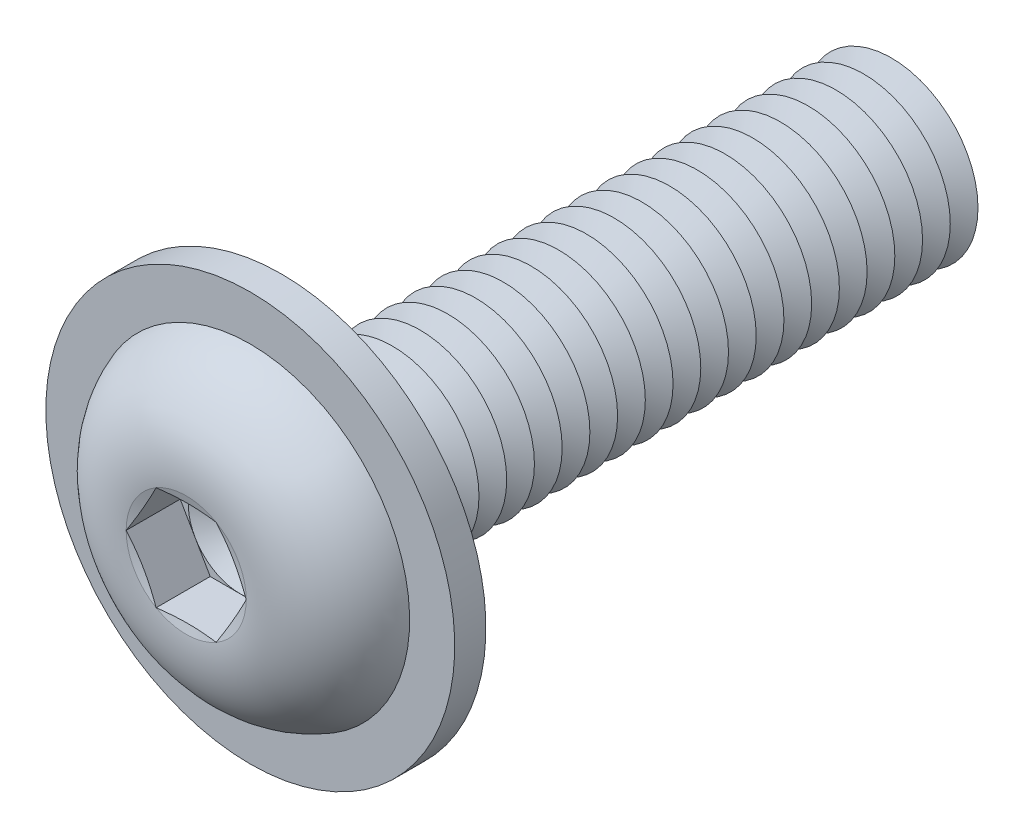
ISO-10303-21;
HEADER;
FILE_DESCRIPTION(('STEP AP214'),'2;1');
FILE_NAME('part.step','',(''),(''),'','','');
FILE_SCHEMA(('AUTOMOTIVE_DESIGN { 1 0 10303 214 1 1 1 1 }'));
ENDSEC;
DATA;
#1=APPLICATION_CONTEXT('core data for automotive mechanical design processes');
#2=APPLICATION_PROTOCOL_DEFINITION('international standard','automotive_design',2000,#1);
#3=PRODUCT_CONTEXT('',#1,'mechanical');
#4=PRODUCT('Part','Part','',(#3));
#5=PRODUCT_RELATED_PRODUCT_CATEGORY('part','',(#4));
#6=PRODUCT_DEFINITION_FORMATION('','',#4);
#7=PRODUCT_DEFINITION_CONTEXT('part definition',#1,'design');
#8=PRODUCT_DEFINITION('design','',#6,#7);
#9=PRODUCT_DEFINITION_SHAPE('','',#8);
#10=(LENGTH_UNIT() NAMED_UNIT(*) SI_UNIT(.MILLI.,.METRE.));
#11=(NAMED_UNIT(*) PLANE_ANGLE_UNIT() SI_UNIT($,.RADIAN.));
#12=(NAMED_UNIT(*) SI_UNIT($,.STERADIAN.) SOLID_ANGLE_UNIT());
#13=UNCERTAINTY_MEASURE_WITH_UNIT(LENGTH_MEASURE(1.E-05),#10,'distance_accuracy_value','');
#14=(GEOMETRIC_REPRESENTATION_CONTEXT(3) GLOBAL_UNCERTAINTY_ASSIGNED_CONTEXT((#13)) GLOBAL_UNIT_ASSIGNED_CONTEXT((#10,
#11,#12)) REPRESENTATION_CONTEXT('',''));
#15=CARTESIAN_POINT('',(0.,0.,0.));
#16=DIRECTION('',(0.,0.,1.));
#17=DIRECTION('',(1.,0.,0.));
#18=AXIS2_PLACEMENT_3D('',#15,#16,#17);
#19=CARTESIAN_POINT('',(0.,0.,-15.2));
#20=DIRECTION('',(0.,0.,1.));
#21=DIRECTION('',(1.,0.,0.));
#22=AXIS2_PLACEMENT_3D('',#19,#20,#21);
#23=CONICAL_SURFACE('',#22,2.50000000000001,1.0471975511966);
#24=CARTESIAN_POINT('',(0.,0.,-15.6));
#25=DIRECTION('',(0.,0.,1.));
#26=DIRECTION('',(1.,0.,0.));
#27=AXIS2_PLACEMENT_3D('',#24,#25,#26);
#28=CIRCLE('',#27,1.80717967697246);
#29=CARTESIAN_POINT('',(1.80717967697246,0.,-15.6));
#30=VERTEX_POINT('',#29);
#31=EDGE_CURVE('E386',#30,#30,#28,.T.);
#32=ORIENTED_EDGE('',*,*,#31,.T.);
#33=EDGE_LOOP('',(#32));
#34=FACE_BOUND('',#33,.T.);
#35=CARTESIAN_POINT('',(0.,0.,-15.2));
#36=DIRECTION('',(0.,0.,1.));
#37=DIRECTION('',(1.,0.,0.));
#38=AXIS2_PLACEMENT_3D('',#35,#36,#37);
#39=CIRCLE('',#38,2.50000000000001);
#40=CARTESIAN_POINT('',(2.50000000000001,0.,-15.2));
#41=VERTEX_POINT('',#40);
#42=EDGE_CURVE('E382',#41,#41,#39,.T.);
#43=ORIENTED_EDGE('',*,*,#42,.F.);
#44=EDGE_LOOP('',(#43));
#45=FACE_BOUND('',#44,.T.);
#46=ADVANCED_FACE('F39',(#34,#45),#23,.T.);
#47=CARTESIAN_POINT('',(0.,0.,-15.6));
#48=DIRECTION('',(0.,0.,-1.));
#49=DIRECTION('',(-1.,0.,0.));
#50=AXIS2_PLACEMENT_3D('',#47,#48,#49);
#51=CONICAL_SURFACE('',#50,1.80717967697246,1.0471975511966);
#52=CARTESIAN_POINT('',(0.,0.,-16.));
#53=DIRECTION('',(0.,0.,1.));
#54=DIRECTION('',(1.,0.,0.));
#55=AXIS2_PLACEMENT_3D('',#52,#53,#54);
#56=CIRCLE('',#55,2.50000000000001);
#57=CARTESIAN_POINT('',(2.50000000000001,0.,-16.));
#58=VERTEX_POINT('',#57);
#59=EDGE_CURVE('E390',#58,#58,#56,.T.);
#60=ORIENTED_EDGE('',*,*,#59,.T.);
#61=EDGE_LOOP('',(#60));
#62=FACE_BOUND('',#61,.T.);
#63=ORIENTED_EDGE('',*,*,#31,.F.);
#64=EDGE_LOOP('',(#63));
#65=FACE_BOUND('',#64,.T.);
#66=ADVANCED_FACE('F514',(#62,#65),#51,.T.);
#67=CARTESIAN_POINT('',(0.,2.50000000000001,-18.));
#68=DIRECTION('',(0.,0.,-1.));
#69=DIRECTION('',(-1.,0.,0.));
#70=AXIS2_PLACEMENT_3D('',#67,#68,#69);
#71=PLANE('',#70);
#72=CARTESIAN_POINT('',(0.,0.,-18.));
#73=DIRECTION('',(0.,0.,1.));
#74=DIRECTION('',(1.,0.,0.));
#75=AXIS2_PLACEMENT_3D('',#72,#73,#74);
#76=CIRCLE('',#75,1.80717967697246);
#77=CARTESIAN_POINT('',(1.80717967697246,0.,-18.));
#78=VERTEX_POINT('',#77);
#79=EDGE_CURVE('E409',#78,#78,#76,.T.);
#80=ORIENTED_EDGE('',*,*,#79,.F.);
#81=EDGE_LOOP('',(#80));
#82=FACE_BOUND('',#81,.T.);
#83=ADVANCED_FACE('F520',(#82),#71,.T.);
#84=CARTESIAN_POINT('',(0.,0.,-17.6));
#85=DIRECTION('',(0.,0.,1.));
#86=DIRECTION('',(1.,0.,0.));
#87=AXIS2_PLACEMENT_3D('',#84,#85,#86);
#88=CONICAL_SURFACE('',#87,2.50000000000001,1.0471975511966);
#89=ORIENTED_EDGE('',*,*,#79,.T.);
#90=EDGE_LOOP('',(#89));
#91=FACE_BOUND('',#90,.T.);
#92=CARTESIAN_POINT('',(0.,0.,-17.6));
#93=DIRECTION('',(0.,0.,1.));
#94=DIRECTION('',(1.,0.,0.));
#95=AXIS2_PLACEMENT_3D('',#92,#93,#94);
#96=CIRCLE('',#95,2.50000000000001);
#97=CARTESIAN_POINT('',(2.50000000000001,0.,-17.6));
#98=VERTEX_POINT('',#97);
#99=EDGE_CURVE('E405',#98,#98,#96,.T.);
#100=ORIENTED_EDGE('',*,*,#99,.F.);
#101=EDGE_LOOP('',(#100));
#102=FACE_BOUND('',#101,.T.);
#103=ADVANCED_FACE('F539',(#91,#102),#88,.T.);
#104=CARTESIAN_POINT('',(0.,0.,-17.2));
#105=DIRECTION('',(0.,0.,-1.));
#106=DIRECTION('',(-1.,0.,0.));
#107=AXIS2_PLACEMENT_3D('',#104,#105,#106);
#108=CONICAL_SURFACE('',#107,1.80717967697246,1.0471975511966);
#109=ORIENTED_EDGE('',*,*,#99,.T.);
#110=EDGE_LOOP('',(#109));
#111=FACE_BOUND('',#110,.T.);
#112=CARTESIAN_POINT('',(0.,0.,-17.2));
#113=DIRECTION('',(0.,0.,1.));
#114=DIRECTION('',(1.,0.,0.));
#115=AXIS2_PLACEMENT_3D('',#112,#113,#114);
#116=CIRCLE('',#115,1.80717967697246);
#117=CARTESIAN_POINT('',(1.80717967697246,0.,-17.2));
#118=VERTEX_POINT('',#117);
#119=EDGE_CURVE('E401',#118,#118,#116,.T.);
#120=ORIENTED_EDGE('',*,*,#119,.F.);
#121=EDGE_LOOP('',(#120));
#122=FACE_BOUND('',#121,.T.);
#123=ADVANCED_FACE('F536',(#111,#122),#108,.T.);
#124=CARTESIAN_POINT('',(0.,0.,-16.8));
#125=DIRECTION('',(0.,0.,1.));
#126=DIRECTION('',(1.,0.,0.));
#127=AXIS2_PLACEMENT_3D('',#124,#125,#126);
#128=CONICAL_SURFACE('',#127,2.50000000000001,1.0471975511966);
#129=ORIENTED_EDGE('',*,*,#119,.T.);
#130=EDGE_LOOP('',(#129));
#131=FACE_BOUND('',#130,.T.);
#132=CARTESIAN_POINT('',(0.,0.,-16.8));
#133=DIRECTION('',(0.,0.,1.));
#134=DIRECTION('',(1.,0.,0.));
#135=AXIS2_PLACEMENT_3D('',#132,#133,#134);
#136=CIRCLE('',#135,2.50000000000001);
#137=CARTESIAN_POINT('',(2.50000000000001,0.,-16.8));
#138=VERTEX_POINT('',#137);
#139=EDGE_CURVE('E397',#138,#138,#136,.T.);
#140=ORIENTED_EDGE('',*,*,#139,.F.);
#141=EDGE_LOOP('',(#140));
#142=FACE_BOUND('',#141,.T.);
#143=ADVANCED_FACE('F530',(#131,#142),#128,.T.);
#144=CARTESIAN_POINT('',(0.,0.,-16.4));
#145=DIRECTION('',(0.,0.,-1.));
#146=DIRECTION('',(-1.,0.,0.));
#147=AXIS2_PLACEMENT_3D('',#144,#145,#146);
#148=CONICAL_SURFACE('',#147,1.80717967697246,1.0471975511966);
#149=ORIENTED_EDGE('',*,*,#139,.T.);
#150=EDGE_LOOP('',(#149));
#151=FACE_BOUND('',#150,.T.);
#152=CARTESIAN_POINT('',(0.,0.,-16.4));
#153=DIRECTION('',(0.,0.,1.));
#154=DIRECTION('',(1.,0.,0.));
#155=AXIS2_PLACEMENT_3D('',#152,#153,#154);
#156=CIRCLE('',#155,1.80717967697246);
#157=CARTESIAN_POINT('',(1.80717967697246,0.,-16.4));
#158=VERTEX_POINT('',#157);
#159=EDGE_CURVE('E394',#158,#158,#156,.T.);
#160=ORIENTED_EDGE('',*,*,#159,.F.);
#161=EDGE_LOOP('',(#160));
#162=FACE_BOUND('',#161,.T.);
#163=ADVANCED_FACE('F526',(#151,#162),#148,.T.);
#164=CARTESIAN_POINT('',(0.,0.,-16.));
#165=DIRECTION('',(0.,0.,1.));
#166=DIRECTION('',(1.,0.,0.));
#167=AXIS2_PLACEMENT_3D('',#164,#165,#166);
#168=CONICAL_SURFACE('',#167,2.50000000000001,1.0471975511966);
#169=ORIENTED_EDGE('',*,*,#159,.T.);
#170=EDGE_LOOP('',(#169));
#171=FACE_BOUND('',#170,.T.);
#172=ORIENTED_EDGE('',*,*,#59,.F.);
#173=EDGE_LOOP('',(#172));
#174=FACE_BOUND('',#173,.T.);
#175=ADVANCED_FACE('F529',(#171,#174),#168,.T.);
#176=CARTESIAN_POINT('',(0.,0.,-14.4));
#177=DIRECTION('',(0.,0.,1.));
#178=DIRECTION('',(1.,0.,0.));
#179=AXIS2_PLACEMENT_3D('',#176,#177,#178);
#180=CONICAL_SURFACE('',#179,2.50000000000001,1.0471975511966);
#181=CARTESIAN_POINT('',(0.,0.,-14.8));
#182=DIRECTION('',(0.,0.,1.));
#183=DIRECTION('',(1.,0.,0.));
#184=AXIS2_PLACEMENT_3D('',#181,#182,#183);
#185=CIRCLE('',#184,1.80717967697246);
#186=CARTESIAN_POINT('',(1.80717967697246,0.,-14.8));
#187=VERTEX_POINT('',#186);
#188=EDGE_CURVE('E378',#187,#187,#185,.T.);
#189=ORIENTED_EDGE('',*,*,#188,.T.);
#190=EDGE_LOOP('',(#189));
#191=FACE_BOUND('',#190,.T.);
#192=CARTESIAN_POINT('',(0.,0.,-14.4));
#193=DIRECTION('',(0.,0.,1.));
#194=DIRECTION('',(1.,0.,0.));
#195=AXIS2_PLACEMENT_3D('',#192,#193,#194);
#196=CIRCLE('',#195,2.50000000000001);
#197=CARTESIAN_POINT('',(2.50000000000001,0.,-14.4));
#198=VERTEX_POINT('',#197);
#199=EDGE_CURVE('E374',#198,#198,#196,.T.);
#200=ORIENTED_EDGE('',*,*,#199,.F.);
#201=EDGE_LOOP('',(#200));
#202=FACE_BOUND('',#201,.T.);
#203=ADVANCED_FACE('F534',(#191,#202),#180,.T.);
#204=CARTESIAN_POINT('',(0.,0.,-14.8));
#205=DIRECTION('',(0.,0.,-1.));
#206=DIRECTION('',(-1.,0.,0.));
#207=AXIS2_PLACEMENT_3D('',#204,#205,#206);
#208=CONICAL_SURFACE('',#207,1.80717967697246,1.0471975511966);
#209=ORIENTED_EDGE('',*,*,#42,.T.);
#210=EDGE_LOOP('',(#209));
#211=FACE_BOUND('',#210,.T.);
#212=ORIENTED_EDGE('',*,*,#188,.F.);
#213=EDGE_LOOP('',(#212));
#214=FACE_BOUND('',#213,.T.);
#215=ADVANCED_FACE('F585',(#211,#214),#208,.T.);
#216=CARTESIAN_POINT('',(0.,0.,-13.6));
#217=DIRECTION('',(0.,0.,1.));
#218=DIRECTION('',(1.,0.,0.));
#219=AXIS2_PLACEMENT_3D('',#216,#217,#218);
#220=CONICAL_SURFACE('',#219,2.50000000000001,1.0471975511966);
#221=CARTESIAN_POINT('',(0.,0.,-14.));
#222=DIRECTION('',(0.,0.,1.));
#223=DIRECTION('',(1.,0.,0.));
#224=AXIS2_PLACEMENT_3D('',#221,#222,#223);
#225=CIRCLE('',#224,1.80717967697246);
#226=CARTESIAN_POINT('',(1.80717967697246,0.,-14.));
#227=VERTEX_POINT('',#226);
#228=EDGE_CURVE('E370',#227,#227,#225,.T.);
#229=ORIENTED_EDGE('',*,*,#228,.T.);
#230=EDGE_LOOP('',(#229));
#231=FACE_BOUND('',#230,.T.);
#232=CARTESIAN_POINT('',(0.,0.,-13.6));
#233=DIRECTION('',(0.,0.,1.));
#234=DIRECTION('',(1.,0.,0.));
#235=AXIS2_PLACEMENT_3D('',#232,#233,#234);
#236=CIRCLE('',#235,2.50000000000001);
#237=CARTESIAN_POINT('',(2.50000000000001,0.,-13.6));
#238=VERTEX_POINT('',#237);
#239=EDGE_CURVE('E366',#238,#238,#236,.T.);
#240=ORIENTED_EDGE('',*,*,#239,.F.);
#241=EDGE_LOOP('',(#240));
#242=FACE_BOUND('',#241,.T.);
#243=ADVANCED_FACE('F591',(#231,#242),#220,.T.);
#244=CARTESIAN_POINT('',(0.,0.,-14.));
#245=DIRECTION('',(0.,0.,-1.));
#246=DIRECTION('',(-1.,0.,0.));
#247=AXIS2_PLACEMENT_3D('',#244,#245,#246);
#248=CONICAL_SURFACE('',#247,1.80717967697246,1.0471975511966);
#249=ORIENTED_EDGE('',*,*,#199,.T.);
#250=EDGE_LOOP('',(#249));
#251=FACE_BOUND('',#250,.T.);
#252=ORIENTED_EDGE('',*,*,#228,.F.);
#253=EDGE_LOOP('',(#252));
#254=FACE_BOUND('',#253,.T.);
#255=ADVANCED_FACE('F598',(#251,#254),#248,.T.);
#256=CARTESIAN_POINT('',(0.,0.,-12.8));
#257=DIRECTION('',(0.,0.,1.));
#258=DIRECTION('',(1.,0.,0.));
#259=AXIS2_PLACEMENT_3D('',#256,#257,#258);
#260=CONICAL_SURFACE('',#259,2.50000000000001,1.0471975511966);
#261=CARTESIAN_POINT('',(0.,0.,-13.2));
#262=DIRECTION('',(0.,0.,1.));
#263=DIRECTION('',(1.,0.,0.));
#264=AXIS2_PLACEMENT_3D('',#261,#262,#263);
#265=CIRCLE('',#264,1.80717967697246);
#266=CARTESIAN_POINT('',(1.80717967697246,0.,-13.2));
#267=VERTEX_POINT('',#266);
#268=EDGE_CURVE('E362',#267,#267,#265,.T.);
#269=ORIENTED_EDGE('',*,*,#268,.T.);
#270=EDGE_LOOP('',(#269));
#271=FACE_BOUND('',#270,.T.);
#272=CARTESIAN_POINT('',(0.,0.,-12.8));
#273=DIRECTION('',(0.,0.,1.));
#274=DIRECTION('',(1.,0.,0.));
#275=AXIS2_PLACEMENT_3D('',#272,#273,#274);
#276=CIRCLE('',#275,2.50000000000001);
#277=CARTESIAN_POINT('',(2.50000000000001,0.,-12.8));
#278=VERTEX_POINT('',#277);
#279=EDGE_CURVE('E358',#278,#278,#276,.T.);
#280=ORIENTED_EDGE('',*,*,#279,.F.);
#281=EDGE_LOOP('',(#280));
#282=FACE_BOUND('',#281,.T.);
#283=ADVANCED_FACE('F605',(#271,#282),#260,.T.);
#284=CARTESIAN_POINT('',(0.,0.,-13.2));
#285=DIRECTION('',(0.,0.,-1.));
#286=DIRECTION('',(-1.,0.,0.));
#287=AXIS2_PLACEMENT_3D('',#284,#285,#286);
#288=CONICAL_SURFACE('',#287,1.80717967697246,1.0471975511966);
#289=ORIENTED_EDGE('',*,*,#239,.T.);
#290=EDGE_LOOP('',(#289));
#291=FACE_BOUND('',#290,.T.);
#292=ORIENTED_EDGE('',*,*,#268,.F.);
#293=EDGE_LOOP('',(#292));
#294=FACE_BOUND('',#293,.T.);
#295=ADVANCED_FACE('F612',(#291,#294),#288,.T.);
#296=CARTESIAN_POINT('',(0.,0.,-12.));
#297=DIRECTION('',(0.,0.,1.));
#298=DIRECTION('',(1.,0.,0.));
#299=AXIS2_PLACEMENT_3D('',#296,#297,#298);
#300=CONICAL_SURFACE('',#299,2.50000000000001,1.0471975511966);
#301=CARTESIAN_POINT('',(0.,0.,-12.4));
#302=DIRECTION('',(0.,0.,1.));
#303=DIRECTION('',(1.,0.,0.));
#304=AXIS2_PLACEMENT_3D('',#301,#302,#303);
#305=CIRCLE('',#304,1.80717967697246);
#306=CARTESIAN_POINT('',(1.80717967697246,0.,-12.4));
#307=VERTEX_POINT('',#306);
#308=EDGE_CURVE('E354',#307,#307,#305,.T.);
#309=ORIENTED_EDGE('',*,*,#308,.T.);
#310=EDGE_LOOP('',(#309));
#311=FACE_BOUND('',#310,.T.);
#312=CARTESIAN_POINT('',(0.,0.,-12.));
#313=DIRECTION('',(0.,0.,1.));
#314=DIRECTION('',(1.,0.,0.));
#315=AXIS2_PLACEMENT_3D('',#312,#313,#314);
#316=CIRCLE('',#315,2.50000000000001);
#317=CARTESIAN_POINT('',(2.50000000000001,0.,-12.));
#318=VERTEX_POINT('',#317);
#319=EDGE_CURVE('E350',#318,#318,#316,.T.);
#320=ORIENTED_EDGE('',*,*,#319,.F.);
#321=EDGE_LOOP('',(#320));
#322=FACE_BOUND('',#321,.T.);
#323=ADVANCED_FACE('F619',(#311,#322),#300,.T.);
#324=CARTESIAN_POINT('',(0.,0.,-12.4));
#325=DIRECTION('',(0.,0.,-1.));
#326=DIRECTION('',(-1.,0.,0.));
#327=AXIS2_PLACEMENT_3D('',#324,#325,#326);
#328=CONICAL_SURFACE('',#327,1.80717967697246,1.0471975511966);
#329=ORIENTED_EDGE('',*,*,#279,.T.);
#330=EDGE_LOOP('',(#329));
#331=FACE_BOUND('',#330,.T.);
#332=ORIENTED_EDGE('',*,*,#308,.F.);
#333=EDGE_LOOP('',(#332));
#334=FACE_BOUND('',#333,.T.);
#335=ADVANCED_FACE('F626',(#331,#334),#328,.T.);
#336=CARTESIAN_POINT('',(0.,0.,-11.2));
#337=DIRECTION('',(0.,0.,1.));
#338=DIRECTION('',(1.,0.,0.));
#339=AXIS2_PLACEMENT_3D('',#336,#337,#338);
#340=CONICAL_SURFACE('',#339,2.50000000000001,1.0471975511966);
#341=CARTESIAN_POINT('',(0.,0.,-11.6));
#342=DIRECTION('',(0.,0.,1.));
#343=DIRECTION('',(1.,0.,0.));
#344=AXIS2_PLACEMENT_3D('',#341,#342,#343);
#345=CIRCLE('',#344,1.80717967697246);
#346=CARTESIAN_POINT('',(1.80717967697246,0.,-11.6));
#347=VERTEX_POINT('',#346);
#348=EDGE_CURVE('E346',#347,#347,#345,.T.);
#349=ORIENTED_EDGE('',*,*,#348,.T.);
#350=EDGE_LOOP('',(#349));
#351=FACE_BOUND('',#350,.T.);
#352=CARTESIAN_POINT('',(0.,0.,-11.2));
#353=DIRECTION('',(0.,0.,1.));
#354=DIRECTION('',(1.,0.,0.));
#355=AXIS2_PLACEMENT_3D('',#352,#353,#354);
#356=CIRCLE('',#355,2.50000000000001);
#357=CARTESIAN_POINT('',(2.50000000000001,0.,-11.2));
#358=VERTEX_POINT('',#357);
#359=EDGE_CURVE('E342',#358,#358,#356,.T.);
#360=ORIENTED_EDGE('',*,*,#359,.F.);
#361=EDGE_LOOP('',(#360));
#362=FACE_BOUND('',#361,.T.);
#363=ADVANCED_FACE('F633',(#351,#362),#340,.T.);
#364=CARTESIAN_POINT('',(0.,0.,-11.6));
#365=DIRECTION('',(0.,0.,-1.));
#366=DIRECTION('',(-1.,0.,0.));
#367=AXIS2_PLACEMENT_3D('',#364,#365,#366);
#368=CONICAL_SURFACE('',#367,1.80717967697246,1.0471975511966);
#369=ORIENTED_EDGE('',*,*,#319,.T.);
#370=EDGE_LOOP('',(#369));
#371=FACE_BOUND('',#370,.T.);
#372=ORIENTED_EDGE('',*,*,#348,.F.);
#373=EDGE_LOOP('',(#372));
#374=FACE_BOUND('',#373,.T.);
#375=ADVANCED_FACE('F640',(#371,#374),#368,.T.);
#376=CARTESIAN_POINT('',(0.,0.,-10.4));
#377=DIRECTION('',(0.,0.,1.));
#378=DIRECTION('',(1.,0.,0.));
#379=AXIS2_PLACEMENT_3D('',#376,#377,#378);
#380=CONICAL_SURFACE('',#379,2.50000000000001,1.0471975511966);
#381=CARTESIAN_POINT('',(0.,0.,-10.8));
#382=DIRECTION('',(0.,0.,1.));
#383=DIRECTION('',(1.,0.,0.));
#384=AXIS2_PLACEMENT_3D('',#381,#382,#383);
#385=CIRCLE('',#384,1.80717967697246);
#386=CARTESIAN_POINT('',(1.80717967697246,0.,-10.8));
#387=VERTEX_POINT('',#386);
#388=EDGE_CURVE('E338',#387,#387,#385,.T.);
#389=ORIENTED_EDGE('',*,*,#388,.T.);
#390=EDGE_LOOP('',(#389));
#391=FACE_BOUND('',#390,.T.);
#392=CARTESIAN_POINT('',(0.,0.,-10.4));
#393=DIRECTION('',(0.,0.,1.));
#394=DIRECTION('',(1.,0.,0.));
#395=AXIS2_PLACEMENT_3D('',#392,#393,#394);
#396=CIRCLE('',#395,2.50000000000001);
#397=CARTESIAN_POINT('',(2.50000000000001,0.,-10.4));
#398=VERTEX_POINT('',#397);
#399=EDGE_CURVE('E334',#398,#398,#396,.T.);
#400=ORIENTED_EDGE('',*,*,#399,.F.);
#401=EDGE_LOOP('',(#400));
#402=FACE_BOUND('',#401,.T.);
#403=ADVANCED_FACE('F647',(#391,#402),#380,.T.);
#404=CARTESIAN_POINT('',(0.,0.,-10.8));
#405=DIRECTION('',(0.,0.,-1.));
#406=DIRECTION('',(-1.,0.,0.));
#407=AXIS2_PLACEMENT_3D('',#404,#405,#406);
#408=CONICAL_SURFACE('',#407,1.80717967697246,1.0471975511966);
#409=ORIENTED_EDGE('',*,*,#359,.T.);
#410=EDGE_LOOP('',(#409));
#411=FACE_BOUND('',#410,.T.);
#412=ORIENTED_EDGE('',*,*,#388,.F.);
#413=EDGE_LOOP('',(#412));
#414=FACE_BOUND('',#413,.T.);
#415=ADVANCED_FACE('F654',(#411,#414),#408,.T.);
#416=CARTESIAN_POINT('',(0.,0.,-9.6));
#417=DIRECTION('',(0.,0.,1.));
#418=DIRECTION('',(1.,0.,0.));
#419=AXIS2_PLACEMENT_3D('',#416,#417,#418);
#420=CONICAL_SURFACE('',#419,2.50000000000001,1.0471975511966);
#421=CARTESIAN_POINT('',(0.,0.,-10.));
#422=DIRECTION('',(0.,0.,1.));
#423=DIRECTION('',(1.,0.,0.));
#424=AXIS2_PLACEMENT_3D('',#421,#422,#423);
#425=CIRCLE('',#424,1.80717967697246);
#426=CARTESIAN_POINT('',(1.80717967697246,0.,-10.));
#427=VERTEX_POINT('',#426);
#428=EDGE_CURVE('E330',#427,#427,#425,.T.);
#429=ORIENTED_EDGE('',*,*,#428,.T.);
#430=EDGE_LOOP('',(#429));
#431=FACE_BOUND('',#430,.T.);
#432=CARTESIAN_POINT('',(0.,0.,-9.6));
#433=DIRECTION('',(0.,0.,1.));
#434=DIRECTION('',(1.,0.,0.));
#435=AXIS2_PLACEMENT_3D('',#432,#433,#434);
#436=CIRCLE('',#435,2.50000000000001);
#437=CARTESIAN_POINT('',(2.50000000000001,0.,-9.6));
#438=VERTEX_POINT('',#437);
#439=EDGE_CURVE('E326',#438,#438,#436,.T.);
#440=ORIENTED_EDGE('',*,*,#439,.F.);
#441=EDGE_LOOP('',(#440));
#442=FACE_BOUND('',#441,.T.);
#443=ADVANCED_FACE('F661',(#431,#442),#420,.T.);
#444=CARTESIAN_POINT('',(0.,0.,-10.));
#445=DIRECTION('',(0.,0.,-1.));
#446=DIRECTION('',(-1.,0.,0.));
#447=AXIS2_PLACEMENT_3D('',#444,#445,#446);
#448=CONICAL_SURFACE('',#447,1.80717967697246,1.0471975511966);
#449=ORIENTED_EDGE('',*,*,#399,.T.);
#450=EDGE_LOOP('',(#449));
#451=FACE_BOUND('',#450,.T.);
#452=ORIENTED_EDGE('',*,*,#428,.F.);
#453=EDGE_LOOP('',(#452));
#454=FACE_BOUND('',#453,.T.);
#455=ADVANCED_FACE('F668',(#451,#454),#448,.T.);
#456=CARTESIAN_POINT('',(0.,0.,-8.8));
#457=DIRECTION('',(0.,0.,1.));
#458=DIRECTION('',(1.,0.,0.));
#459=AXIS2_PLACEMENT_3D('',#456,#457,#458);
#460=CONICAL_SURFACE('',#459,2.50000000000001,1.0471975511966);
#461=CARTESIAN_POINT('',(0.,0.,-9.2));
#462=DIRECTION('',(0.,0.,1.));
#463=DIRECTION('',(1.,0.,0.));
#464=AXIS2_PLACEMENT_3D('',#461,#462,#463);
#465=CIRCLE('',#464,1.80717967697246);
#466=CARTESIAN_POINT('',(1.80717967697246,0.,-9.2));
#467=VERTEX_POINT('',#466);
#468=EDGE_CURVE('E322',#467,#467,#465,.T.);
#469=ORIENTED_EDGE('',*,*,#468,.T.);
#470=EDGE_LOOP('',(#469));
#471=FACE_BOUND('',#470,.T.);
#472=CARTESIAN_POINT('',(0.,0.,-8.8));
#473=DIRECTION('',(0.,0.,1.));
#474=DIRECTION('',(1.,0.,0.));
#475=AXIS2_PLACEMENT_3D('',#472,#473,#474);
#476=CIRCLE('',#475,2.50000000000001);
#477=CARTESIAN_POINT('',(2.50000000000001,0.,-8.8));
#478=VERTEX_POINT('',#477);
#479=EDGE_CURVE('E318',#478,#478,#476,.T.);
#480=ORIENTED_EDGE('',*,*,#479,.F.);
#481=EDGE_LOOP('',(#480));
#482=FACE_BOUND('',#481,.T.);
#483=ADVANCED_FACE('F675',(#471,#482),#460,.T.);
#484=CARTESIAN_POINT('',(0.,0.,-9.2));
#485=DIRECTION('',(0.,0.,-1.));
#486=DIRECTION('',(-1.,0.,0.));
#487=AXIS2_PLACEMENT_3D('',#484,#485,#486);
#488=CONICAL_SURFACE('',#487,1.80717967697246,1.0471975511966);
#489=ORIENTED_EDGE('',*,*,#439,.T.);
#490=EDGE_LOOP('',(#489));
#491=FACE_BOUND('',#490,.T.);
#492=ORIENTED_EDGE('',*,*,#468,.F.);
#493=EDGE_LOOP('',(#492));
#494=FACE_BOUND('',#493,.T.);
#495=ADVANCED_FACE('F682',(#491,#494),#488,.T.);
#496=CARTESIAN_POINT('',(0.,0.,-8.));
#497=DIRECTION('',(0.,0.,1.));
#498=DIRECTION('',(1.,0.,0.));
#499=AXIS2_PLACEMENT_3D('',#496,#497,#498);
#500=CONICAL_SURFACE('',#499,2.50000000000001,1.0471975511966);
#501=CARTESIAN_POINT('',(0.,0.,-8.4));
#502=DIRECTION('',(0.,0.,1.));
#503=DIRECTION('',(1.,0.,0.));
#504=AXIS2_PLACEMENT_3D('',#501,#502,#503);
#505=CIRCLE('',#504,1.80717967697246);
#506=CARTESIAN_POINT('',(1.80717967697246,0.,-8.4));
#507=VERTEX_POINT('',#506);
#508=EDGE_CURVE('E314',#507,#507,#505,.T.);
#509=ORIENTED_EDGE('',*,*,#508,.T.);
#510=EDGE_LOOP('',(#509));
#511=FACE_BOUND('',#510,.T.);
#512=CARTESIAN_POINT('',(0.,0.,-8.));
#513=DIRECTION('',(0.,0.,1.));
#514=DIRECTION('',(1.,0.,0.));
#515=AXIS2_PLACEMENT_3D('',#512,#513,#514);
#516=CIRCLE('',#515,2.50000000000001);
#517=CARTESIAN_POINT('',(2.50000000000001,0.,-8.));
#518=VERTEX_POINT('',#517);
#519=EDGE_CURVE('E310',#518,#518,#516,.T.);
#520=ORIENTED_EDGE('',*,*,#519,.F.);
#521=EDGE_LOOP('',(#520));
#522=FACE_BOUND('',#521,.T.);
#523=ADVANCED_FACE('F689',(#511,#522),#500,.T.);
#524=CARTESIAN_POINT('',(0.,0.,-8.4));
#525=DIRECTION('',(0.,0.,-1.));
#526=DIRECTION('',(-1.,0.,0.));
#527=AXIS2_PLACEMENT_3D('',#524,#525,#526);
#528=CONICAL_SURFACE('',#527,1.80717967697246,1.0471975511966);
#529=ORIENTED_EDGE('',*,*,#479,.T.);
#530=EDGE_LOOP('',(#529));
#531=FACE_BOUND('',#530,.T.);
#532=ORIENTED_EDGE('',*,*,#508,.F.);
#533=EDGE_LOOP('',(#532));
#534=FACE_BOUND('',#533,.T.);
#535=ADVANCED_FACE('F696',(#531,#534),#528,.T.);
#536=CARTESIAN_POINT('',(0.,0.,-7.2));
#537=DIRECTION('',(0.,0.,1.));
#538=DIRECTION('',(1.,0.,0.));
#539=AXIS2_PLACEMENT_3D('',#536,#537,#538);
#540=CONICAL_SURFACE('',#539,2.50000000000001,1.0471975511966);
#541=CARTESIAN_POINT('',(0.,0.,-7.6));
#542=DIRECTION('',(0.,0.,1.));
#543=DIRECTION('',(1.,0.,0.));
#544=AXIS2_PLACEMENT_3D('',#541,#542,#543);
#545=CIRCLE('',#544,1.80717967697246);
#546=CARTESIAN_POINT('',(1.80717967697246,0.,-7.6));
#547=VERTEX_POINT('',#546);
#548=EDGE_CURVE('E306',#547,#547,#545,.T.);
#549=ORIENTED_EDGE('',*,*,#548,.T.);
#550=EDGE_LOOP('',(#549));
#551=FACE_BOUND('',#550,.T.);
#552=CARTESIAN_POINT('',(0.,0.,-7.2));
#553=DIRECTION('',(0.,0.,1.));
#554=DIRECTION('',(1.,0.,0.));
#555=AXIS2_PLACEMENT_3D('',#552,#553,#554);
#556=CIRCLE('',#555,2.50000000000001);
#557=CARTESIAN_POINT('',(2.50000000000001,0.,-7.2));
#558=VERTEX_POINT('',#557);
#559=EDGE_CURVE('E302',#558,#558,#556,.T.);
#560=ORIENTED_EDGE('',*,*,#559,.F.);
#561=EDGE_LOOP('',(#560));
#562=FACE_BOUND('',#561,.T.);
#563=ADVANCED_FACE('F703',(#551,#562),#540,.T.);
#564=CARTESIAN_POINT('',(0.,0.,-7.6));
#565=DIRECTION('',(0.,0.,-1.));
#566=DIRECTION('',(-1.,0.,0.));
#567=AXIS2_PLACEMENT_3D('',#564,#565,#566);
#568=CONICAL_SURFACE('',#567,1.80717967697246,1.0471975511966);
#569=ORIENTED_EDGE('',*,*,#519,.T.);
#570=EDGE_LOOP('',(#569));
#571=FACE_BOUND('',#570,.T.);
#572=ORIENTED_EDGE('',*,*,#548,.F.);
#573=EDGE_LOOP('',(#572));
#574=FACE_BOUND('',#573,.T.);
#575=ADVANCED_FACE('F710',(#571,#574),#568,.T.);
#576=CARTESIAN_POINT('',(0.,0.,-6.4));
#577=DIRECTION('',(0.,0.,1.));
#578=DIRECTION('',(1.,0.,0.));
#579=AXIS2_PLACEMENT_3D('',#576,#577,#578);
#580=CONICAL_SURFACE('',#579,2.50000000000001,1.0471975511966);
#581=CARTESIAN_POINT('',(0.,0.,-6.8));
#582=DIRECTION('',(0.,0.,1.));
#583=DIRECTION('',(1.,0.,0.));
#584=AXIS2_PLACEMENT_3D('',#581,#582,#583);
#585=CIRCLE('',#584,1.80717967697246);
#586=CARTESIAN_POINT('',(1.80717967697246,0.,-6.8));
#587=VERTEX_POINT('',#586);
#588=EDGE_CURVE('E298',#587,#587,#585,.T.);
#589=ORIENTED_EDGE('',*,*,#588,.T.);
#590=EDGE_LOOP('',(#589));
#591=FACE_BOUND('',#590,.T.);
#592=CARTESIAN_POINT('',(0.,0.,-6.4));
#593=DIRECTION('',(0.,0.,1.));
#594=DIRECTION('',(1.,0.,0.));
#595=AXIS2_PLACEMENT_3D('',#592,#593,#594);
#596=CIRCLE('',#595,2.50000000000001);
#597=CARTESIAN_POINT('',(2.50000000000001,0.,-6.4));
#598=VERTEX_POINT('',#597);
#599=EDGE_CURVE('E294',#598,#598,#596,.T.);
#600=ORIENTED_EDGE('',*,*,#599,.F.);
#601=EDGE_LOOP('',(#600));
#602=FACE_BOUND('',#601,.T.);
#603=ADVANCED_FACE('F717',(#591,#602),#580,.T.);
#604=CARTESIAN_POINT('',(0.,0.,-6.8));
#605=DIRECTION('',(0.,0.,-1.));
#606=DIRECTION('',(-1.,0.,0.));
#607=AXIS2_PLACEMENT_3D('',#604,#605,#606);
#608=CONICAL_SURFACE('',#607,1.80717967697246,1.0471975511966);
#609=ORIENTED_EDGE('',*,*,#559,.T.);
#610=EDGE_LOOP('',(#609));
#611=FACE_BOUND('',#610,.T.);
#612=ORIENTED_EDGE('',*,*,#588,.F.);
#613=EDGE_LOOP('',(#612));
#614=FACE_BOUND('',#613,.T.);
#615=ADVANCED_FACE('F724',(#611,#614),#608,.T.);
#616=CARTESIAN_POINT('',(0.,0.,-5.6));
#617=DIRECTION('',(0.,0.,1.));
#618=DIRECTION('',(1.,0.,0.));
#619=AXIS2_PLACEMENT_3D('',#616,#617,#618);
#620=CONICAL_SURFACE('',#619,2.50000000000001,1.0471975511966);
#621=CARTESIAN_POINT('',(0.,0.,-6.));
#622=DIRECTION('',(0.,0.,1.));
#623=DIRECTION('',(1.,0.,0.));
#624=AXIS2_PLACEMENT_3D('',#621,#622,#623);
#625=CIRCLE('',#624,1.80717967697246);
#626=CARTESIAN_POINT('',(1.80717967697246,0.,-6.));
#627=VERTEX_POINT('',#626);
#628=EDGE_CURVE('E290',#627,#627,#625,.T.);
#629=ORIENTED_EDGE('',*,*,#628,.T.);
#630=EDGE_LOOP('',(#629));
#631=FACE_BOUND('',#630,.T.);
#632=CARTESIAN_POINT('',(0.,0.,-5.6));
#633=DIRECTION('',(0.,0.,1.));
#634=DIRECTION('',(1.,0.,0.));
#635=AXIS2_PLACEMENT_3D('',#632,#633,#634);
#636=CIRCLE('',#635,2.50000000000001);
#637=CARTESIAN_POINT('',(2.50000000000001,0.,-5.6));
#638=VERTEX_POINT('',#637);
#639=EDGE_CURVE('E286',#638,#638,#636,.T.);
#640=ORIENTED_EDGE('',*,*,#639,.F.);
#641=EDGE_LOOP('',(#640));
#642=FACE_BOUND('',#641,.T.);
#643=ADVANCED_FACE('F731',(#631,#642),#620,.T.);
#644=CARTESIAN_POINT('',(0.,0.,-6.));
#645=DIRECTION('',(0.,0.,-1.));
#646=DIRECTION('',(-1.,0.,0.));
#647=AXIS2_PLACEMENT_3D('',#644,#645,#646);
#648=CONICAL_SURFACE('',#647,1.80717967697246,1.0471975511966);
#649=ORIENTED_EDGE('',*,*,#599,.T.);
#650=EDGE_LOOP('',(#649));
#651=FACE_BOUND('',#650,.T.);
#652=ORIENTED_EDGE('',*,*,#628,.F.);
#653=EDGE_LOOP('',(#652));
#654=FACE_BOUND('',#653,.T.);
#655=ADVANCED_FACE('F738',(#651,#654),#648,.T.);
#656=CARTESIAN_POINT('',(0.,0.,-4.8));
#657=DIRECTION('',(0.,0.,1.));
#658=DIRECTION('',(1.,0.,0.));
#659=AXIS2_PLACEMENT_3D('',#656,#657,#658);
#660=CONICAL_SURFACE('',#659,2.50000000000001,1.0471975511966);
#661=CARTESIAN_POINT('',(0.,0.,-5.2));
#662=DIRECTION('',(0.,0.,1.));
#663=DIRECTION('',(1.,0.,0.));
#664=AXIS2_PLACEMENT_3D('',#661,#662,#663);
#665=CIRCLE('',#664,1.80717967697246);
#666=CARTESIAN_POINT('',(1.80717967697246,0.,-5.2));
#667=VERTEX_POINT('',#666);
#668=EDGE_CURVE('E282',#667,#667,#665,.T.);
#669=ORIENTED_EDGE('',*,*,#668,.T.);
#670=EDGE_LOOP('',(#669));
#671=FACE_BOUND('',#670,.T.);
#672=CARTESIAN_POINT('',(0.,0.,-4.8));
#673=DIRECTION('',(0.,0.,1.));
#674=DIRECTION('',(1.,0.,0.));
#675=AXIS2_PLACEMENT_3D('',#672,#673,#674);
#676=CIRCLE('',#675,2.50000000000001);
#677=CARTESIAN_POINT('',(2.50000000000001,0.,-4.8));
#678=VERTEX_POINT('',#677);
#679=EDGE_CURVE('E278',#678,#678,#676,.T.);
#680=ORIENTED_EDGE('',*,*,#679,.F.);
#681=EDGE_LOOP('',(#680));
#682=FACE_BOUND('',#681,.T.);
#683=ADVANCED_FACE('F745',(#671,#682),#660,.T.);
#684=CARTESIAN_POINT('',(0.,0.,-5.2));
#685=DIRECTION('',(0.,0.,-1.));
#686=DIRECTION('',(-1.,0.,0.));
#687=AXIS2_PLACEMENT_3D('',#684,#685,#686);
#688=CONICAL_SURFACE('',#687,1.80717967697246,1.0471975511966);
#689=ORIENTED_EDGE('',*,*,#639,.T.);
#690=EDGE_LOOP('',(#689));
#691=FACE_BOUND('',#690,.T.);
#692=ORIENTED_EDGE('',*,*,#668,.F.);
#693=EDGE_LOOP('',(#692));
#694=FACE_BOUND('',#693,.T.);
#695=ADVANCED_FACE('F752',(#691,#694),#688,.T.);
#696=CARTESIAN_POINT('',(0.,0.,-4.));
#697=DIRECTION('',(0.,0.,1.));
#698=DIRECTION('',(1.,0.,0.));
#699=AXIS2_PLACEMENT_3D('',#696,#697,#698);
#700=CONICAL_SURFACE('',#699,2.50000000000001,1.0471975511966);
#701=CARTESIAN_POINT('',(0.,0.,-4.4));
#702=DIRECTION('',(0.,0.,1.));
#703=DIRECTION('',(1.,0.,0.));
#704=AXIS2_PLACEMENT_3D('',#701,#702,#703);
#705=CIRCLE('',#704,1.80717967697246);
#706=CARTESIAN_POINT('',(1.80717967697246,0.,-4.4));
#707=VERTEX_POINT('',#706);
#708=EDGE_CURVE('E274',#707,#707,#705,.T.);
#709=ORIENTED_EDGE('',*,*,#708,.T.);
#710=EDGE_LOOP('',(#709));
#711=FACE_BOUND('',#710,.T.);
#712=CARTESIAN_POINT('',(0.,0.,-4.));
#713=DIRECTION('',(0.,0.,1.));
#714=DIRECTION('',(1.,0.,0.));
#715=AXIS2_PLACEMENT_3D('',#712,#713,#714);
#716=CIRCLE('',#715,2.50000000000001);
#717=CARTESIAN_POINT('',(2.50000000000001,0.,-4.));
#718=VERTEX_POINT('',#717);
#719=EDGE_CURVE('E270',#718,#718,#716,.T.);
#720=ORIENTED_EDGE('',*,*,#719,.F.);
#721=EDGE_LOOP('',(#720));
#722=FACE_BOUND('',#721,.T.);
#723=ADVANCED_FACE('F759',(#711,#722),#700,.T.);
#724=CARTESIAN_POINT('',(0.,0.,-4.4));
#725=DIRECTION('',(0.,0.,-1.));
#726=DIRECTION('',(-1.,0.,0.));
#727=AXIS2_PLACEMENT_3D('',#724,#725,#726);
#728=CONICAL_SURFACE('',#727,1.80717967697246,1.0471975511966);
#729=ORIENTED_EDGE('',*,*,#679,.T.);
#730=EDGE_LOOP('',(#729));
#731=FACE_BOUND('',#730,.T.);
#732=ORIENTED_EDGE('',*,*,#708,.F.);
#733=EDGE_LOOP('',(#732));
#734=FACE_BOUND('',#733,.T.);
#735=ADVANCED_FACE('F766',(#731,#734),#728,.T.);
#736=CARTESIAN_POINT('',(0.,0.,-3.2));
#737=DIRECTION('',(0.,0.,1.));
#738=DIRECTION('',(1.,0.,0.));
#739=AXIS2_PLACEMENT_3D('',#736,#737,#738);
#740=CONICAL_SURFACE('',#739,2.50000000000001,1.0471975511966);
#741=CARTESIAN_POINT('',(0.,0.,-3.6));
#742=DIRECTION('',(0.,0.,1.));
#743=DIRECTION('',(1.,0.,0.));
#744=AXIS2_PLACEMENT_3D('',#741,#742,#743);
#745=CIRCLE('',#744,1.80717967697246);
#746=CARTESIAN_POINT('',(1.80717967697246,0.,-3.6));
#747=VERTEX_POINT('',#746);
#748=EDGE_CURVE('E266',#747,#747,#745,.T.);
#749=ORIENTED_EDGE('',*,*,#748,.T.);
#750=EDGE_LOOP('',(#749));
#751=FACE_BOUND('',#750,.T.);
#752=CARTESIAN_POINT('',(0.,0.,-3.2));
#753=DIRECTION('',(0.,0.,1.));
#754=DIRECTION('',(1.,0.,0.));
#755=AXIS2_PLACEMENT_3D('',#752,#753,#754);
#756=CIRCLE('',#755,2.50000000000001);
#757=CARTESIAN_POINT('',(2.50000000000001,0.,-3.2));
#758=VERTEX_POINT('',#757);
#759=EDGE_CURVE('E262',#758,#758,#756,.T.);
#760=ORIENTED_EDGE('',*,*,#759,.F.);
#761=EDGE_LOOP('',(#760));
#762=FACE_BOUND('',#761,.T.);
#763=ADVANCED_FACE('F773',(#751,#762),#740,.T.);
#764=CARTESIAN_POINT('',(0.,0.,-3.6));
#765=DIRECTION('',(0.,0.,-1.));
#766=DIRECTION('',(-1.,0.,0.));
#767=AXIS2_PLACEMENT_3D('',#764,#765,#766);
#768=CONICAL_SURFACE('',#767,1.80717967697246,1.0471975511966);
#769=ORIENTED_EDGE('',*,*,#719,.T.);
#770=EDGE_LOOP('',(#769));
#771=FACE_BOUND('',#770,.T.);
#772=ORIENTED_EDGE('',*,*,#748,.F.);
#773=EDGE_LOOP('',(#772));
#774=FACE_BOUND('',#773,.T.);
#775=ADVANCED_FACE('F780',(#771,#774),#768,.T.);
#776=CARTESIAN_POINT('',(0.,0.,-2.4));
#777=DIRECTION('',(0.,0.,1.));
#778=DIRECTION('',(1.,0.,0.));
#779=AXIS2_PLACEMENT_3D('',#776,#777,#778);
#780=CONICAL_SURFACE('',#779,2.50000000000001,1.0471975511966);
#781=CARTESIAN_POINT('',(0.,0.,-2.8));
#782=DIRECTION('',(0.,0.,1.));
#783=DIRECTION('',(1.,0.,0.));
#784=AXIS2_PLACEMENT_3D('',#781,#782,#783);
#785=CIRCLE('',#784,1.80717967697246);
#786=CARTESIAN_POINT('',(1.80717967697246,0.,-2.8));
#787=VERTEX_POINT('',#786);
#788=EDGE_CURVE('E258',#787,#787,#785,.T.);
#789=ORIENTED_EDGE('',*,*,#788,.T.);
#790=EDGE_LOOP('',(#789));
#791=FACE_BOUND('',#790,.T.);
#792=CARTESIAN_POINT('',(0.,0.,-2.4));
#793=DIRECTION('',(0.,0.,1.));
#794=DIRECTION('',(1.,0.,0.));
#795=AXIS2_PLACEMENT_3D('',#792,#793,#794);
#796=CIRCLE('',#795,2.50000000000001);
#797=CARTESIAN_POINT('',(2.50000000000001,0.,-2.4));
#798=VERTEX_POINT('',#797);
#799=EDGE_CURVE('E254',#798,#798,#796,.T.);
#800=ORIENTED_EDGE('',*,*,#799,.F.);
#801=EDGE_LOOP('',(#800));
#802=FACE_BOUND('',#801,.T.);
#803=ADVANCED_FACE('F787',(#791,#802),#780,.T.);
#804=CARTESIAN_POINT('',(0.,0.,-2.8));
#805=DIRECTION('',(0.,0.,-1.));
#806=DIRECTION('',(-1.,0.,0.));
#807=AXIS2_PLACEMENT_3D('',#804,#805,#806);
#808=CONICAL_SURFACE('',#807,1.80717967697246,1.0471975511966);
#809=ORIENTED_EDGE('',*,*,#759,.T.);
#810=EDGE_LOOP('',(#809));
#811=FACE_BOUND('',#810,.T.);
#812=ORIENTED_EDGE('',*,*,#788,.F.);
#813=EDGE_LOOP('',(#812));
#814=FACE_BOUND('',#813,.T.);
#815=ADVANCED_FACE('F794',(#811,#814),#808,.T.);
#816=CARTESIAN_POINT('',(0.,0.,-1.6));
#817=DIRECTION('',(0.,0.,1.));
#818=DIRECTION('',(1.,0.,0.));
#819=AXIS2_PLACEMENT_3D('',#816,#817,#818);
#820=CONICAL_SURFACE('',#819,2.50000000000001,1.0471975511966);
#821=CARTESIAN_POINT('',(0.,0.,-2.));
#822=DIRECTION('',(0.,0.,1.));
#823=DIRECTION('',(1.,0.,0.));
#824=AXIS2_PLACEMENT_3D('',#821,#822,#823);
#825=CIRCLE('',#824,1.80717967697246);
#826=CARTESIAN_POINT('',(1.80717967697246,0.,-2.));
#827=VERTEX_POINT('',#826);
#828=EDGE_CURVE('E250',#827,#827,#825,.T.);
#829=ORIENTED_EDGE('',*,*,#828,.T.);
#830=EDGE_LOOP('',(#829));
#831=FACE_BOUND('',#830,.T.);
#832=CARTESIAN_POINT('',(0.,0.,-1.6));
#833=DIRECTION('',(0.,0.,1.));
#834=DIRECTION('',(1.,0.,0.));
#835=AXIS2_PLACEMENT_3D('',#832,#833,#834);
#836=CIRCLE('',#835,2.50000000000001);
#837=CARTESIAN_POINT('',(2.50000000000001,0.,-1.6));
#838=VERTEX_POINT('',#837);
#839=EDGE_CURVE('E243',#838,#838,#836,.T.);
#840=ORIENTED_EDGE('',*,*,#839,.F.);
#841=EDGE_LOOP('',(#840));
#842=FACE_BOUND('',#841,.T.);
#843=ADVANCED_FACE('F801',(#831,#842),#820,.T.);
#844=CARTESIAN_POINT('',(0.,0.,-2.));
#845=DIRECTION('',(0.,0.,-1.));
#846=DIRECTION('',(-1.,0.,0.));
#847=AXIS2_PLACEMENT_3D('',#844,#845,#846);
#848=CONICAL_SURFACE('',#847,1.80717967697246,1.0471975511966);
#849=ORIENTED_EDGE('',*,*,#799,.T.);
#850=EDGE_LOOP('',(#849));
#851=FACE_BOUND('',#850,.T.);
#852=ORIENTED_EDGE('',*,*,#828,.F.);
#853=EDGE_LOOP('',(#852));
#854=FACE_BOUND('',#853,.T.);
#855=ADVANCED_FACE('F808',(#851,#854),#848,.T.);
#856=CARTESIAN_POINT('',(0.,0.,-0.799999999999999));
#857=DIRECTION('',(0.,0.,1.));
#858=DIRECTION('',(1.,0.,0.));
#859=AXIS2_PLACEMENT_3D('',#856,#857,#858);
#860=CONICAL_SURFACE('',#859,2.50000000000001,1.0471975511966);
#861=CARTESIAN_POINT('',(0.,0.,-1.2));
#862=DIRECTION('',(0.,0.,1.));
#863=DIRECTION('',(1.,0.,0.));
#864=AXIS2_PLACEMENT_3D('',#861,#862,#863);
#865=CIRCLE('',#864,1.80717967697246);
#866=CARTESIAN_POINT('',(1.80717967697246,0.,-1.2));
#867=VERTEX_POINT('',#866);
#868=EDGE_CURVE('E232',#867,#867,#865,.T.);
#869=ORIENTED_EDGE('',*,*,#868,.T.);
#870=EDGE_LOOP('',(#869));
#871=FACE_BOUND('',#870,.T.);
#872=CARTESIAN_POINT('',(0.,0.,-0.799999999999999));
#873=DIRECTION('',(0.,0.,1.));
#874=DIRECTION('',(1.,0.,0.));
#875=AXIS2_PLACEMENT_3D('',#872,#873,#874);
#876=CIRCLE('',#875,2.50000000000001);
#877=CARTESIAN_POINT('',(2.50000000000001,0.,-0.799999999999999));
#878=VERTEX_POINT('',#877);
#879=EDGE_CURVE('E246',#878,#878,#876,.T.);
#880=ORIENTED_EDGE('',*,*,#879,.F.);
#881=EDGE_LOOP('',(#880));
#882=FACE_BOUND('',#881,.T.);
#883=ADVANCED_FACE('F815',(#871,#882),#860,.T.);
#884=CARTESIAN_POINT('',(0.,0.,-1.2));
#885=DIRECTION('',(0.,0.,-1.));
#886=DIRECTION('',(-1.,0.,0.));
#887=AXIS2_PLACEMENT_3D('',#884,#885,#886);
#888=CONICAL_SURFACE('',#887,1.80717967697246,1.0471975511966);
#889=ORIENTED_EDGE('',*,*,#839,.T.);
#890=EDGE_LOOP('',(#889));
#891=FACE_BOUND('',#890,.T.);
#892=ORIENTED_EDGE('',*,*,#868,.F.);
#893=EDGE_LOOP('',(#892));
#894=FACE_BOUND('',#893,.T.);
#895=ADVANCED_FACE('F221',(#891,#894),#888,.T.);
#896=CARTESIAN_POINT('',(0.,2.5,0.));
#897=DIRECTION('',(0.,0.,-1.));
#898=DIRECTION('',(-1.,0.,0.));
#899=AXIS2_PLACEMENT_3D('',#896,#897,#898);
#900=PLANE('',#899);
#901=CARTESIAN_POINT('',(0.,0.,0.));
#902=DIRECTION('',(0.,0.,-1.));
#903=DIRECTION('',(-1.,0.,0.));
#904=AXIS2_PLACEMENT_3D('',#901,#902,#903);
#905=CIRCLE('',#904,2.9);
#906=CARTESIAN_POINT('',(-2.9,0.,0.));
#907=VERTEX_POINT('',#906);
#908=EDGE_CURVE('E423',#907,#907,#905,.F.);
#909=ORIENTED_EDGE('',*,*,#908,.T.);
#910=EDGE_LOOP('',(#909));
#911=FACE_BOUND('',#910,.T.);
#912=CARTESIAN_POINT('',(0.,0.,0.));
#913=DIRECTION('',(0.,0.,-1.));
#914=DIRECTION('',(0.,1.,0.));
#915=AXIS2_PLACEMENT_3D('',#912,#913,#914);
#916=CIRCLE('',#915,5.9);
#917=CARTESIAN_POINT('',(0.,5.9,0.));
#918=VERTEX_POINT('',#917);
#919=EDGE_CURVE('E1233',#918,#918,#916,.T.);
#920=ORIENTED_EDGE('',*,*,#919,.T.);
#921=EDGE_LOOP('',(#920));
#922=FACE_BOUND('',#921,.T.);
#923=ADVANCED_FACE('F827',(#911,#922),#900,.T.);
#924=CARTESIAN_POINT('',(0.,0.,-0.400000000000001));
#925=DIRECTION('',(0.,0.,-1.));
#926=DIRECTION('',(-1.,0.,0.));
#927=AXIS2_PLACEMENT_3D('',#924,#925,#926);
#928=TOROIDAL_SURFACE('',#927,2.9,0.4);
#929=ORIENTED_EDGE('',*,*,#908,.F.);
#930=EDGE_LOOP('',(#929));
#931=FACE_BOUND('',#930,.T.);
#932=CARTESIAN_POINT('',(0.,0.,-0.400000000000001));
#933=DIRECTION('',(0.,0.,-1.));
#934=DIRECTION('',(-1.,0.,0.));
#935=AXIS2_PLACEMENT_3D('',#932,#933,#934);
#936=CIRCLE('',#935,2.5);
#937=CARTESIAN_POINT('',(-2.5,0.,-0.400000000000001));
#938=VERTEX_POINT('',#937);
#939=EDGE_CURVE('E418',#938,#938,#936,.T.);
#940=ORIENTED_EDGE('',*,*,#939,.F.);
#941=EDGE_LOOP('',(#940));
#942=FACE_BOUND('',#941,.T.);
#943=ADVANCED_FACE('F41',(#931,#942),#928,.F.);
#944=CARTESIAN_POINT('',(0.,0.,-18.));
#945=DIRECTION('',(0.,0.,-1.));
#946=DIRECTION('',(-1.,0.,0.));
#947=AXIS2_PLACEMENT_3D('',#944,#945,#946);
#948=CYLINDRICAL_SURFACE('',#947,2.5);
#949=ORIENTED_EDGE('',*,*,#939,.T.);
#950=EDGE_LOOP('',(#949));
#951=FACE_BOUND('',#950,.T.);
#952=ORIENTED_EDGE('',*,*,#879,.T.);
#953=EDGE_LOOP('',(#952));
#954=FACE_BOUND('',#953,.T.);
#955=ADVANCED_FACE('F839',(#951,#954),#948,.T.);
#956=CARTESIAN_POINT('',(0.,0.,0.9));
#957=DIRECTION('',(0.,0.,-1.));
#958=DIRECTION('',(0.,1.,0.));
#959=AXIS2_PLACEMENT_3D('',#956,#957,#958);
#960=CYLINDRICAL_SURFACE('',#959,5.9);
#961=CARTESIAN_POINT('',(0.,0.,0.9));
#962=DIRECTION('',(0.,0.,-1.));
#963=DIRECTION('',(0.,1.,0.));
#964=AXIS2_PLACEMENT_3D('',#961,#962,#963);
#965=CIRCLE('',#964,5.9);
#966=CARTESIAN_POINT('',(0.,5.9,0.9));
#967=VERTEX_POINT('',#966);
#968=EDGE_CURVE('E1231',#967,#967,#965,.T.);
#969=ORIENTED_EDGE('',*,*,#968,.T.);
#970=EDGE_LOOP('',(#969));
#971=FACE_BOUND('',#970,.T.);
#972=ORIENTED_EDGE('',*,*,#919,.F.);
#973=EDGE_LOOP('',(#972));
#974=FACE_BOUND('',#973,.T.);
#975=ADVANCED_FACE('F845',(#971,#974),#960,.T.);
#976=CARTESIAN_POINT('',(0.,0.,0.9));
#977=DIRECTION('',(0.,0.,-1.));
#978=DIRECTION('',(0.,1.,0.));
#979=AXIS2_PLACEMENT_3D('',#976,#977,#978);
#980=PLANE('',#979);
#981=CARTESIAN_POINT('',(0.,0.,0.9));
#982=DIRECTION('',(0.,0.,-1.));
#983=DIRECTION('',(0.,1.,0.));
#984=AXIS2_PLACEMENT_3D('',#981,#982,#983);
#985=CIRCLE('',#984,4.59924727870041);
#986=CARTESIAN_POINT('',(0.,4.59924727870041,0.9));
#987=VERTEX_POINT('',#986);
#988=EDGE_CURVE('E43',#987,#987,#985,.F.);
#989=ORIENTED_EDGE('',*,*,#988,.F.);
#990=EDGE_LOOP('',(#989));
#991=FACE_BOUND('',#990,.T.);
#992=ORIENTED_EDGE('',*,*,#968,.F.);
#993=EDGE_LOOP('',(#992));
#994=FACE_BOUND('',#993,.T.);
#995=ADVANCED_FACE('F117',(#991,#994),#980,.F.);
#996=CARTESIAN_POINT('',(0.,0.,1.19));
#997=DIRECTION('',(0.,0.,1.));
#998=DIRECTION('',(1.,0.,0.));
#999=AXIS2_PLACEMENT_3D('',#996,#997,#998);
#1000=CONICAL_SURFACE('',#999,1.49999930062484,1.0471975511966);
#1001=CARTESIAN_POINT('',(0.,0.,0.323975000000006));
#1002=VERTEX_POINT('',#1001);
#1003=VERTEX_LOOP('',#1002);
#1004=FACE_BOUND('',#1003,.T.);
#1005=CARTESIAN_POINT('',(0.,0.,1.19));
#1006=DIRECTION('',(0.,0.,1.));
#1007=DIRECTION('',(1.,0.,0.));
#1008=AXIS2_PLACEMENT_3D('',#1005,#1006,#1007);
#1009=CIRCLE('',#1008,1.49999930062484);
#1010=CARTESIAN_POINT('',(1.2990375,0.749999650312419,1.19));
#1011=VERTEX_POINT('',#1010);
#1012=CARTESIAN_POINT('',(0.,1.49999930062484,1.19));
#1013=VERTEX_POINT('',#1012);
#1014=EDGE_CURVE('E120',#1011,#1013,#1009,.T.);
#1015=ORIENTED_EDGE('',*,*,#1014,.T.);
#1016=CARTESIAN_POINT('',(0.,0.,1.19));
#1017=DIRECTION('',(0.,0.,1.));
#1018=DIRECTION('',(1.,0.,0.));
#1019=AXIS2_PLACEMENT_3D('',#1016,#1017,#1018);
#1020=CIRCLE('',#1019,1.49999930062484);
#1021=CARTESIAN_POINT('',(-1.2990375,0.749999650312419,1.19));
#1022=VERTEX_POINT('',#1021);
#1023=EDGE_CURVE('E11',#1013,#1022,#1020,.T.);
#1024=ORIENTED_EDGE('',*,*,#1023,.T.);
#1025=CARTESIAN_POINT('',(-1.2990375,-0.749999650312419,1.19));
#1026=VERTEX_POINT('',#1025);
#1027=EDGE_CURVE('E49',#1022,#1026,#1020,.T.);
#1028=ORIENTED_EDGE('',*,*,#1027,.T.);
#1029=CARTESIAN_POINT('',(0.,-1.49999930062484,1.19));
#1030=VERTEX_POINT('',#1029);
#1031=EDGE_CURVE('E428',#1026,#1030,#1020,.T.);
#1032=ORIENTED_EDGE('',*,*,#1031,.T.);
#1033=CARTESIAN_POINT('',(1.2990375,-0.749999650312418,1.19));
#1034=VERTEX_POINT('',#1033);
#1035=EDGE_CURVE('E57',#1030,#1034,#1020,.T.);
#1036=ORIENTED_EDGE('',*,*,#1035,.T.);
#1037=EDGE_CURVE('E50',#1034,#1011,#1020,.T.);
#1038=ORIENTED_EDGE('',*,*,#1037,.T.);
#1039=EDGE_LOOP('',(#1015,#1024,#1028,#1032,#1036,#1038));
#1040=FACE_BOUND('',#1039,.T.);
#1041=ADVANCED_FACE('F114',(#1004,#1040),#1000,.F.);
#1042=CARTESIAN_POINT('',(0.,0.,1.19));
#1043=DIRECTION('',(0.,0.,1.));
#1044=DIRECTION('',(1.,0.,0.));
#1045=AXIS2_PLACEMENT_3D('',#1042,#1043,#1044);
#1046=PLANE('',#1045);
#1047=ORIENTED_EDGE('',*,*,#1031,.F.);
#1048=DIRECTION('',(0.5,-0.866025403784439,0.));
#1049=VECTOR('',#1048,1.);
#1050=CARTESIAN_POINT('',(-1.73205,0.,1.19));
#1051=LINE('',#1050,#1049);
#1052=CARTESIAN_POINT('',(-0.866025,-1.49999930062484,1.19));
#1053=VERTEX_POINT('',#1052);
#1054=EDGE_CURVE('E154',#1026,#1053,#1051,.T.);
#1055=ORIENTED_EDGE('',*,*,#1054,.T.);
#1056=DIRECTION('',(1.,0.,0.));
#1057=VECTOR('',#1056,1.);
#1058=CARTESIAN_POINT('',(-0.866025,-1.49999930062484,1.19));
#1059=LINE('',#1058,#1057);
#1060=EDGE_CURVE('E160',#1053,#1030,#1059,.T.);
#1061=ORIENTED_EDGE('',*,*,#1060,.T.);
#1062=EDGE_LOOP('',(#1047,#1055,#1061));
#1063=FACE_BOUND('',#1062,.T.);
#1064=ADVANCED_FACE('F116',(#1063),#1046,.T.);
#1065=ORIENTED_EDGE('',*,*,#1035,.F.);
#1066=CARTESIAN_POINT('',(0.866024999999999,-1.49999930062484,1.19));
#1067=VERTEX_POINT('',#1066);
#1068=EDGE_CURVE('E159',#1030,#1067,#1059,.T.);
#1069=ORIENTED_EDGE('',*,*,#1068,.T.);
#1070=DIRECTION('',(0.5,0.866025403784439,0.));
#1071=VECTOR('',#1070,1.);
#1072=CARTESIAN_POINT('',(0.866024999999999,-1.49999930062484,1.19));
#1073=LINE('',#1072,#1071);
#1074=EDGE_CURVE('E165',#1067,#1034,#1073,.T.);
#1075=ORIENTED_EDGE('',*,*,#1074,.T.);
#1076=EDGE_LOOP('',(#1065,#1069,#1075));
#1077=FACE_BOUND('',#1076,.T.);
#1078=ADVANCED_FACE('F866',(#1077),#1046,.T.);
#1079=ORIENTED_EDGE('',*,*,#1037,.F.);
#1080=CARTESIAN_POINT('',(1.73205,0.,1.19));
#1081=VERTEX_POINT('',#1080);
#1082=EDGE_CURVE('E164',#1034,#1081,#1073,.T.);
#1083=ORIENTED_EDGE('',*,*,#1082,.T.);
#1084=DIRECTION('',(-0.5,0.866025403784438,0.));
#1085=VECTOR('',#1084,1.);
#1086=CARTESIAN_POINT('',(1.73205,0.,1.19));
#1087=LINE('',#1086,#1085);
#1088=EDGE_CURVE('E142',#1081,#1011,#1087,.T.);
#1089=ORIENTED_EDGE('',*,*,#1088,.T.);
#1090=EDGE_LOOP('',(#1079,#1083,#1089));
#1091=FACE_BOUND('',#1090,.T.);
#1092=ADVANCED_FACE('F871',(#1091),#1046,.T.);
#1093=ORIENTED_EDGE('',*,*,#1014,.F.);
#1094=CARTESIAN_POINT('',(0.866025,1.49999930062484,1.19));
#1095=VERTEX_POINT('',#1094);
#1096=EDGE_CURVE('E127',#1011,#1095,#1087,.T.);
#1097=ORIENTED_EDGE('',*,*,#1096,.T.);
#1098=DIRECTION('',(-1.,0.,0.));
#1099=VECTOR('',#1098,1.);
#1100=CARTESIAN_POINT('',(0.866025,1.49999930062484,1.19));
#1101=LINE('',#1100,#1099);
#1102=EDGE_CURVE('E138',#1095,#1013,#1101,.T.);
#1103=ORIENTED_EDGE('',*,*,#1102,.T.);
#1104=EDGE_LOOP('',(#1093,#1097,#1103));
#1105=FACE_BOUND('',#1104,.T.);
#1106=ADVANCED_FACE('F144',(#1105),#1046,.T.);
#1107=ORIENTED_EDGE('',*,*,#1023,.F.);
#1108=CARTESIAN_POINT('',(-0.866025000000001,1.49999930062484,1.19));
#1109=VERTEX_POINT('',#1108);
#1110=EDGE_CURVE('E133',#1013,#1109,#1101,.T.);
#1111=ORIENTED_EDGE('',*,*,#1110,.T.);
#1112=DIRECTION('',(-0.5,-0.866025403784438,0.));
#1113=VECTOR('',#1112,1.);
#1114=CARTESIAN_POINT('',(-0.866025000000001,1.49999930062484,1.19));
#1115=LINE('',#1114,#1113);
#1116=EDGE_CURVE('E136',#1109,#1022,#1115,.T.);
#1117=ORIENTED_EDGE('',*,*,#1116,.T.);
#1118=EDGE_LOOP('',(#1107,#1111,#1117));
#1119=FACE_BOUND('',#1118,.T.);
#1120=ADVANCED_FACE('F132',(#1119),#1046,.T.);
#1121=ORIENTED_EDGE('',*,*,#1027,.F.);
#1122=CARTESIAN_POINT('',(-1.73205,0.,1.19));
#1123=VERTEX_POINT('',#1122);
#1124=EDGE_CURVE('E146',#1022,#1123,#1115,.T.);
#1125=ORIENTED_EDGE('',*,*,#1124,.T.);
#1126=EDGE_CURVE('E155',#1123,#1026,#1051,.T.);
#1127=ORIENTED_EDGE('',*,*,#1126,.T.);
#1128=EDGE_LOOP('',(#1121,#1125,#1127));
#1129=FACE_BOUND('',#1128,.T.);
#1130=ADVANCED_FACE('F445',(#1129),#1046,.T.);
#1131=CARTESIAN_POINT('',(-1.73205,0.,1.19));
#1132=DIRECTION('',(-0.866025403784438,-0.5,0.));
#1133=DIRECTION('',(0.5,-0.866025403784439,0.));
#1134=AXIS2_PLACEMENT_3D('',#1131,#1132,#1133);
#1135=PLANE('',#1134);
#1136=CARTESIAN_POINT('',(-1.73216547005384,0.000200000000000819,2.75003094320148));
#1137=CARTESIAN_POINT('',(-1.69619207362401,-0.0621077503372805,2.74038633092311));
#1138=CARTESIAN_POINT('',(-1.66015343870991,-0.124528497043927,2.73163050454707));
#1139=CARTESIAN_POINT('',(-1.58794885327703,-0.249590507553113,2.71624720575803));
#1140=CARTESIAN_POINT('',(-1.55178285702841,-0.312231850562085,2.70962059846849));
#1141=CARTESIAN_POINT('',(-1.47954289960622,-0.437355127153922,2.69888271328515));
#1142=CARTESIAN_POINT('',(-1.4434694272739,-0.499836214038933,2.69475862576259));
#1143=CARTESIAN_POINT('',(-1.37127646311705,-0.624878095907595,2.68922863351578));
#1144=CARTESIAN_POINT('',(-1.33515698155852,-0.687438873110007,2.68782220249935));
#1145=CARTESIAN_POINT('',(-1.26291801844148,-0.812560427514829,2.68782220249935));
#1146=CARTESIAN_POINT('',(-1.22679853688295,-0.87512120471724,2.68922863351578));
#1147=CARTESIAN_POINT('',(-1.1546055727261,-1.0001630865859,2.69475862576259));
#1148=CARTESIAN_POINT('',(-1.11853210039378,-1.06264417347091,2.69888271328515));
#1149=CARTESIAN_POINT('',(-1.0462921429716,-1.18776745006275,2.70962059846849));
#1150=CARTESIAN_POINT('',(-1.01012614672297,-1.25040879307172,2.71624720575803));
#1151=CARTESIAN_POINT('',(-0.937921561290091,-1.37547080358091,2.73163050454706));
#1152=CARTESIAN_POINT('',(-0.901882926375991,-1.43789155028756,2.74038633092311));
#1153=CARTESIAN_POINT('',(-0.865909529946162,-1.50019930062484,2.75003094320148));
#1154=B_SPLINE_CURVE_WITH_KNOTS('',3,(#1136,#1137,#1138,#1139,#1140,#1141,#1142,#1143,#1144,
#1145,#1146,#1147,#1148,#1149,#1150,#1151,#1152,#1153),.UNSPECIFIED.,.F.,.F.,(4,2,2,2,2,2,2,2,
4),(0.,0.217782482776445,0.435653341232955,0.652399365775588,0.869103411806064,1.08580745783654,
1.30255348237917,1.52042434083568,1.73820682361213),.UNSPECIFIED.);
#1155=CARTESIAN_POINT('',(-1.73205,0.,2.75));
#1156=VERTEX_POINT('',#1155);
#1157=CARTESIAN_POINT('',(-0.866025,-1.49999930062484,2.75));
#1158=VERTEX_POINT('',#1157);
#1159=EDGE_CURVE('E450',#1156,#1158,#1154,.T.);
#1160=ORIENTED_EDGE('',*,*,#1159,.T.);
#1161=DIRECTION('',(0.,0.,1.));
#1162=VECTOR('',#1161,1.);
#1163=CARTESIAN_POINT('',(-0.866025,-1.49999930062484,1.19));
#1164=LINE('',#1163,#1162);
#1165=EDGE_CURVE('E178',#1053,#1158,#1164,.T.);
#1166=ORIENTED_EDGE('',*,*,#1165,.F.);
#1167=ORIENTED_EDGE('',*,*,#1054,.F.);
#1168=ORIENTED_EDGE('',*,*,#1126,.F.);
#1169=DIRECTION('',(0.,0.,1.));
#1170=VECTOR('',#1169,1.);
#1171=CARTESIAN_POINT('',(-1.73205,0.,1.19));
#1172=LINE('',#1171,#1170);
#1173=EDGE_CURVE('E182',#1123,#1156,#1172,.T.);
#1174=ORIENTED_EDGE('',*,*,#1173,.T.);
#1175=EDGE_LOOP('',(#1160,#1166,#1167,#1168,#1174));
#1176=FACE_BOUND('',#1175,.T.);
#1177=ADVANCED_FACE('F443',(#1176),#1135,.F.);
#1178=CARTESIAN_POINT('',(-0.866025,-1.49999930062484,1.19));
#1179=DIRECTION('',(0.,-1.,0.));
#1180=DIRECTION('',(0.,0.,-1.));
#1181=AXIS2_PLACEMENT_3D('',#1178,#1179,#1180);
#1182=PLANE('',#1181);
#1183=CARTESIAN_POINT('',(-2.61375031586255,-1.49999930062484,3.09338600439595));
#1184=CARTESIAN_POINT('',(-2.48719895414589,-1.49999930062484,3.06401688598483));
#1185=CARTESIAN_POINT('',(-2.36054180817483,-1.49999930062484,3.03507426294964));
#1186=CARTESIAN_POINT('',(-2.10688190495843,-1.49999930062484,2.97862489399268));
#1187=CARTESIAN_POINT('',(-1.97987908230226,-1.49999930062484,2.95111844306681));
#1188=CARTESIAN_POINT('',(-1.72425281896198,-1.49999930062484,2.89788845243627));
#1189=CARTESIAN_POINT('',(-1.59562534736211,-1.49999930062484,2.87218404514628));
#1190=CARTESIAN_POINT('',(-1.33776732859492,-1.49999930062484,2.82387586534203));
#1191=CARTESIAN_POINT('',(-1.20853672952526,-1.49999930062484,2.80127236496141));
#1192=CARTESIAN_POINT('',(-0.952831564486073,-1.49999930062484,2.76126658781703));
#1193=CARTESIAN_POINT('',(-0.826376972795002,-1.49999930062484,2.74374018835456));
#1194=CARTESIAN_POINT('',(-0.572755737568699,-1.49999930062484,2.71502809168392));
#1195=CARTESIAN_POINT('',(-0.445589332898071,-1.49999930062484,2.70384038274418));
#1196=CARTESIAN_POINT('',(-0.191333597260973,-1.49999930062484,2.68972083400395));
#1197=CARTESIAN_POINT('',(-0.0642464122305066,-1.49999930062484,2.68675270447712));
#1198=CARTESIAN_POINT('',(0.189835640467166,-1.49999930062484,2.68959577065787));
#1199=CARTESIAN_POINT('',(0.31683049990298,-1.49999930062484,2.69540767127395));
#1200=CARTESIAN_POINT('',(0.53418249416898,-1.49999930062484,2.71190493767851));
#1201=CARTESIAN_POINT('',(0.624691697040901,-1.49999930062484,2.72073513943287));
#1202=CARTESIAN_POINT('',(0.80533656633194,-1.49999930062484,2.74156379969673));
#1203=CARTESIAN_POINT('',(0.895472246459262,-1.49999930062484,2.75356214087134));
#1204=CARTESIAN_POINT('',(1.0756572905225,-1.49999930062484,2.78006977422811));
#1205=CARTESIAN_POINT('',(1.16570548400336,-1.49999930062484,2.7945868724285));
#1206=CARTESIAN_POINT('',(1.3454787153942,-1.49999930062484,2.82550612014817));
#1207=CARTESIAN_POINT('',(1.43520373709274,-1.49999930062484,2.8419083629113));
#1208=CARTESIAN_POINT('',(1.61622412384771,-1.49999930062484,2.87648604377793));
#1209=CARTESIAN_POINT('',(1.70751379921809,-1.49999930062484,2.89469103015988));
#1210=CARTESIAN_POINT('',(1.88986344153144,-1.49999930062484,2.93221618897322));
#1211=CARTESIAN_POINT('',(1.98092340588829,-1.49999930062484,2.95153637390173));
#1212=CARTESIAN_POINT('',(2.16236354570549,-1.49999930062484,2.99091506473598));
#1213=CARTESIAN_POINT('',(2.25274472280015,-1.49999930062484,3.01096897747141));
#1214=CARTESIAN_POINT('',(2.43335289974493,-1.49999930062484,3.05173139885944));
#1215=CARTESIAN_POINT('',(2.52357990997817,-1.49999930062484,3.07243986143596));
#1216=CARTESIAN_POINT('',(2.61375031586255,-1.49999930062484,3.09338600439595));
#1217=B_SPLINE_CURVE_WITH_KNOTS('',3,(#1183,#1184,#1185,#1186,#1187,#1188,#1189,#1190,#1191,
#1192,#1193,#1194,#1195,#1196,#1197,#1198,#1199,#1200,#1201,#1202,#1203,#1204,#1205,#1206,#1207,
#1208,#1209,#1210,#1211,#1212,#1213,#1214,#1215,#1216),.UNSPECIFIED.,.F.,.F.,(4,2,2,2,2,2,2,2,2,
2,2,2,2,2,2,2,4),(0.,0.389753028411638,0.779585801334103,1.17307326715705,1.5665952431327,
1.94947555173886,2.33223427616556,2.71330039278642,3.09439710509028,3.36715350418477,
3.63989980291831,3.91350699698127,4.18712773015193,4.4663802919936,4.74563598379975,
5.02337106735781,5.30108664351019),.UNSPECIFIED.);
#1218=CARTESIAN_POINT('',(0.866024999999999,-1.49999930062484,2.75));
#1219=VERTEX_POINT('',#1218);
#1220=EDGE_CURVE('E457',#1158,#1219,#1217,.T.);
#1221=ORIENTED_EDGE('',*,*,#1220,.T.);
#1222=DIRECTION('',(0.,0.,1.));
#1223=VECTOR('',#1222,1.);
#1224=CARTESIAN_POINT('',(0.866024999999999,-1.49999930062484,1.19));
#1225=LINE('',#1224,#1223);
#1226=EDGE_CURVE('E174',#1067,#1219,#1225,.T.);
#1227=ORIENTED_EDGE('',*,*,#1226,.F.);
#1228=ORIENTED_EDGE('',*,*,#1068,.F.);
#1229=ORIENTED_EDGE('',*,*,#1060,.F.);
#1230=ORIENTED_EDGE('',*,*,#1165,.T.);
#1231=EDGE_LOOP('',(#1221,#1227,#1228,#1229,#1230));
#1232=FACE_BOUND('',#1231,.T.);
#1233=ADVANCED_FACE('F503',(#1232),#1182,.F.);
#1234=CARTESIAN_POINT('',(0.866024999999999,-1.49999930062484,1.19));
#1235=DIRECTION('',(0.866025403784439,-0.5,0.));
#1236=DIRECTION('',(0.5,0.866025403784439,0.));
#1237=AXIS2_PLACEMENT_3D('',#1234,#1235,#1236);
#1238=PLANE('',#1237);
#1239=CARTESIAN_POINT('',(0.865909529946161,-1.50019930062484,2.75003094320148));
#1240=CARTESIAN_POINT('',(0.90188292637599,-1.43789155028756,2.74038633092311));
#1241=CARTESIAN_POINT('',(0.93792156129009,-1.37547080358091,2.73163050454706));
#1242=CARTESIAN_POINT('',(1.01012614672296,-1.25040879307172,2.71624720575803));
#1243=CARTESIAN_POINT('',(1.04629214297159,-1.18776745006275,2.70962059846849));
#1244=CARTESIAN_POINT('',(1.11853210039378,-1.06264417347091,2.69888271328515));
#1245=CARTESIAN_POINT('',(1.1546055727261,-1.0001630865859,2.69475862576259));
#1246=CARTESIAN_POINT('',(1.22679853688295,-0.87512120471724,2.68922863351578));
#1247=CARTESIAN_POINT('',(1.26291801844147,-0.812560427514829,2.68782220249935));
#1248=CARTESIAN_POINT('',(1.33515698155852,-0.687438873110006,2.68782220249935));
#1249=CARTESIAN_POINT('',(1.37127646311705,-0.624878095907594,2.68922863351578));
#1250=CARTESIAN_POINT('',(1.4434694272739,-0.499836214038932,2.69475862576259));
#1251=CARTESIAN_POINT('',(1.47954289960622,-0.437355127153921,2.69888271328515));
#1252=CARTESIAN_POINT('',(1.5517828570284,-0.312231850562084,2.70962059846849));
#1253=CARTESIAN_POINT('',(1.58794885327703,-0.249590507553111,2.71624720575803));
#1254=CARTESIAN_POINT('',(1.66015343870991,-0.124528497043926,2.73163050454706));
#1255=CARTESIAN_POINT('',(1.69619207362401,-0.0621077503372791,2.74038633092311));
#1256=CARTESIAN_POINT('',(1.73216547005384,0.000200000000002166,2.75003094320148));
#1257=B_SPLINE_CURVE_WITH_KNOTS('',3,(#1239,#1240,#1241,#1242,#1243,#1244,#1245,#1246,#1247,
#1248,#1249,#1250,#1251,#1252,#1253,#1254,#1255,#1256),.UNSPECIFIED.,.F.,.F.,(4,2,2,2,2,2,2,2,
4),(0.,0.217782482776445,0.435653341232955,0.652399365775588,0.869103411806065,1.08580745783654,
1.30255348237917,1.52042434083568,1.73820682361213),.UNSPECIFIED.);
#1258=CARTESIAN_POINT('',(1.73205,0.,2.75));
#1259=VERTEX_POINT('',#1258);
#1260=EDGE_CURVE('E233',#1219,#1259,#1257,.T.);
#1261=ORIENTED_EDGE('',*,*,#1260,.T.);
#1262=DIRECTION('',(0.,0.,1.));
#1263=VECTOR('',#1262,1.);
#1264=CARTESIAN_POINT('',(1.73205,0.,1.19));
#1265=LINE('',#1264,#1263);
#1266=EDGE_CURVE('E169',#1081,#1259,#1265,.T.);
#1267=ORIENTED_EDGE('',*,*,#1266,.F.);
#1268=ORIENTED_EDGE('',*,*,#1082,.F.);
#1269=ORIENTED_EDGE('',*,*,#1074,.F.);
#1270=ORIENTED_EDGE('',*,*,#1226,.T.);
#1271=EDGE_LOOP('',(#1261,#1267,#1268,#1269,#1270));
#1272=FACE_BOUND('',#1271,.T.);
#1273=ADVANCED_FACE('F219',(#1272),#1238,.F.);
#1274=CARTESIAN_POINT('',(1.73205,0.,1.19));
#1275=DIRECTION('',(0.866025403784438,0.5,0.));
#1276=DIRECTION('',(-0.5,0.866025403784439,0.));
#1277=AXIS2_PLACEMENT_3D('',#1274,#1275,#1276);
#1278=PLANE('',#1277);
#1279=CARTESIAN_POINT('',(1.73216547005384,-0.000199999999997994,2.75003094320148));
#1280=CARTESIAN_POINT('',(1.69619207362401,0.0621077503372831,2.74038633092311));
#1281=CARTESIAN_POINT('',(1.66015343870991,0.12452849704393,2.73163050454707));
#1282=CARTESIAN_POINT('',(1.58794885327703,0.249590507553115,2.71624720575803));
#1283=CARTESIAN_POINT('',(1.5517828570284,0.312231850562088,2.70962059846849));
#1284=CARTESIAN_POINT('',(1.47954289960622,0.437355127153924,2.69888271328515));
#1285=CARTESIAN_POINT('',(1.4434694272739,0.499836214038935,2.69475862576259));
#1286=CARTESIAN_POINT('',(1.37127646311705,0.624878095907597,2.68922863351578));
#1287=CARTESIAN_POINT('',(1.33515698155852,0.687438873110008,2.68782220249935));
#1288=CARTESIAN_POINT('',(1.26291801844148,0.812560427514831,2.68782220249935));
#1289=CARTESIAN_POINT('',(1.22679853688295,0.875121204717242,2.68922863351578));
#1290=CARTESIAN_POINT('',(1.1546055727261,1.0001630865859,2.69475862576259));
#1291=CARTESIAN_POINT('',(1.11853210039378,1.06264417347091,2.69888271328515));
#1292=CARTESIAN_POINT('',(1.0462921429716,1.18776745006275,2.70962059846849));
#1293=CARTESIAN_POINT('',(1.01012614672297,1.25040879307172,2.71624720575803));
#1294=CARTESIAN_POINT('',(0.937921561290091,1.37547080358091,2.73163050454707));
#1295=CARTESIAN_POINT('',(0.901882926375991,1.43789155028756,2.74038633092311));
#1296=CARTESIAN_POINT('',(0.865909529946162,1.50019930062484,2.75003094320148));
#1297=B_SPLINE_CURVE_WITH_KNOTS('',3,(#1279,#1280,#1281,#1282,#1283,#1284,#1285,#1286,#1287,
#1288,#1289,#1290,#1291,#1292,#1293,#1294,#1295,#1296),.UNSPECIFIED.,.F.,.F.,(4,2,2,2,2,2,2,2,
4),(0.,0.217782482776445,0.435653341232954,0.652399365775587,0.869103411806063,1.08580745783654,
1.30255348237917,1.52042434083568,1.73820682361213),.UNSPECIFIED.);
#1298=CARTESIAN_POINT('',(0.866025,1.49999930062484,2.75));
#1299=VERTEX_POINT('',#1298);
#1300=EDGE_CURVE('E224',#1259,#1299,#1297,.T.);
#1301=ORIENTED_EDGE('',*,*,#1300,.T.);
#1302=DIRECTION('',(0.,0.,1.));
#1303=VECTOR('',#1302,1.);
#1304=CARTESIAN_POINT('',(0.866025,1.49999930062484,1.19));
#1305=LINE('',#1304,#1303);
#1306=EDGE_CURVE('E65',#1095,#1299,#1305,.T.);
#1307=ORIENTED_EDGE('',*,*,#1306,.F.);
#1308=ORIENTED_EDGE('',*,*,#1096,.F.);
#1309=ORIENTED_EDGE('',*,*,#1088,.F.);
#1310=ORIENTED_EDGE('',*,*,#1266,.T.);
#1311=EDGE_LOOP('',(#1301,#1307,#1308,#1309,#1310));
#1312=FACE_BOUND('',#1311,.T.);
#1313=ADVANCED_FACE('F213',(#1312),#1278,.F.);
#1314=CARTESIAN_POINT('',(0.866025,1.49999930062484,1.19));
#1315=DIRECTION('',(0.,1.,0.));
#1316=DIRECTION('',(-1.,0.,0.));
#1317=AXIS2_PLACEMENT_3D('',#1314,#1315,#1316);
#1318=PLANE('',#1317);
#1319=CARTESIAN_POINT('',(2.61375031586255,1.49999930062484,3.09338600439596));
#1320=CARTESIAN_POINT('',(2.48719895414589,1.49999930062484,3.06401688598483));
#1321=CARTESIAN_POINT('',(2.36054180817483,1.49999930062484,3.03507426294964));
#1322=CARTESIAN_POINT('',(2.10688190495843,1.49999930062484,2.97862489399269));
#1323=CARTESIAN_POINT('',(1.97987908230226,1.49999930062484,2.95111844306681));
#1324=CARTESIAN_POINT('',(1.72425281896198,1.49999930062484,2.89788845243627));
#1325=CARTESIAN_POINT('',(1.59562534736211,1.49999930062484,2.87218404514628));
#1326=CARTESIAN_POINT('',(1.33776732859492,1.49999930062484,2.82387586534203));
#1327=CARTESIAN_POINT('',(1.20853672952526,1.49999930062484,2.80127236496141));
#1328=CARTESIAN_POINT('',(0.952831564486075,1.49999930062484,2.76126658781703));
#1329=CARTESIAN_POINT('',(0.826376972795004,1.49999930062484,2.74374018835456));
#1330=CARTESIAN_POINT('',(0.5727557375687,1.49999930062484,2.71502809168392));
#1331=CARTESIAN_POINT('',(0.445589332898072,1.49999930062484,2.70384038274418));
#1332=CARTESIAN_POINT('',(0.191333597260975,1.49999930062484,2.68972083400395));
#1333=CARTESIAN_POINT('',(0.0642464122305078,1.49999930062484,2.68675270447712));
#1334=CARTESIAN_POINT('',(-0.189835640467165,1.49999930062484,2.68959577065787));
#1335=CARTESIAN_POINT('',(-0.316830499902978,1.49999930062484,2.69540767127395));
#1336=CARTESIAN_POINT('',(-0.534182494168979,1.49999930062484,2.71190493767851));
#1337=CARTESIAN_POINT('',(-0.6246916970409,1.49999930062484,2.72073513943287));
#1338=CARTESIAN_POINT('',(-0.80533656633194,1.49999930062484,2.74156379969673));
#1339=CARTESIAN_POINT('',(-0.895472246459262,1.49999930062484,2.75356214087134));
#1340=CARTESIAN_POINT('',(-1.0756572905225,1.49999930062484,2.78006977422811));
#1341=CARTESIAN_POINT('',(-1.16570548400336,1.49999930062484,2.7945868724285));
#1342=CARTESIAN_POINT('',(-1.3454787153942,1.49999930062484,2.82550612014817));
#1343=CARTESIAN_POINT('',(-1.43520373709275,1.49999930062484,2.8419083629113));
#1344=CARTESIAN_POINT('',(-1.61622412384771,1.49999930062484,2.87648604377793));
#1345=CARTESIAN_POINT('',(-1.70751379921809,1.49999930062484,2.89469103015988));
#1346=CARTESIAN_POINT('',(-1.88986344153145,1.49999930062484,2.93221618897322));
#1347=CARTESIAN_POINT('',(-1.98092340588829,1.49999930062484,2.95153637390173));
#1348=CARTESIAN_POINT('',(-2.16236354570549,1.49999930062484,2.99091506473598));
#1349=CARTESIAN_POINT('',(-2.25274472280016,1.49999930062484,3.01096897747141));
#1350=CARTESIAN_POINT('',(-2.43335289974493,1.49999930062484,3.05173139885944));
#1351=CARTESIAN_POINT('',(-2.52357990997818,1.49999930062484,3.07243986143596));
#1352=CARTESIAN_POINT('',(-2.61375031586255,1.49999930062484,3.09338600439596));
#1353=B_SPLINE_CURVE_WITH_KNOTS('',3,(#1319,#1320,#1321,#1322,#1323,#1324,#1325,#1326,#1327,
#1328,#1329,#1330,#1331,#1332,#1333,#1334,#1335,#1336,#1337,#1338,#1339,#1340,#1341,#1342,#1343,
#1344,#1345,#1346,#1347,#1348,#1349,#1350,#1351,#1352),.UNSPECIFIED.,.F.,.F.,(4,2,2,2,2,2,2,2,2,
2,2,2,2,2,2,2,4),(0.,0.389753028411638,0.779585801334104,1.17307326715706,1.5665952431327,
1.94947555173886,2.33223427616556,2.71330039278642,3.09439710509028,3.36715350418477,
3.63989980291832,3.91350699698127,4.18712773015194,4.4663802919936,4.74563598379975,
5.02337106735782,5.3010866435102),.UNSPECIFIED.);
#1354=CARTESIAN_POINT('',(-0.866025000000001,1.49999930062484,2.75));
#1355=VERTEX_POINT('',#1354);
#1356=EDGE_CURVE('E173',#1299,#1355,#1353,.T.);
#1357=ORIENTED_EDGE('',*,*,#1356,.T.);
#1358=DIRECTION('',(0.,0.,1.));
#1359=VECTOR('',#1358,1.);
#1360=CARTESIAN_POINT('',(-0.866025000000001,1.49999930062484,1.19));
#1361=LINE('',#1360,#1359);
#1362=EDGE_CURVE('E140',#1109,#1355,#1361,.T.);
#1363=ORIENTED_EDGE('',*,*,#1362,.F.);
#1364=ORIENTED_EDGE('',*,*,#1110,.F.);
#1365=ORIENTED_EDGE('',*,*,#1102,.F.);
#1366=ORIENTED_EDGE('',*,*,#1306,.T.);
#1367=EDGE_LOOP('',(#1357,#1363,#1364,#1365,#1366));
#1368=FACE_BOUND('',#1367,.T.);
#1369=ADVANCED_FACE('F137',(#1368),#1318,.F.);
#1370=CARTESIAN_POINT('',(-0.866025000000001,1.49999930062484,1.19));
#1371=DIRECTION('',(-0.866025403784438,0.5,0.));
#1372=DIRECTION('',(-0.5,-0.866025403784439,0.));
#1373=AXIS2_PLACEMENT_3D('',#1370,#1371,#1372);
#1374=PLANE('',#1373);
#1375=CARTESIAN_POINT('',(-0.865909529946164,1.50019930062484,2.75003094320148));
#1376=CARTESIAN_POINT('',(-0.901882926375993,1.43789155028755,2.74038633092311));
#1377=CARTESIAN_POINT('',(-0.937921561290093,1.37547080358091,2.73163050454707));
#1378=CARTESIAN_POINT('',(-1.01012614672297,1.25040879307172,2.71624720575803));
#1379=CARTESIAN_POINT('',(-1.0462921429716,1.18776745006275,2.70962059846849));
#1380=CARTESIAN_POINT('',(-1.11853210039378,1.06264417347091,2.69888271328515));
#1381=CARTESIAN_POINT('',(-1.1546055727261,1.0001630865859,2.69475862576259));
#1382=CARTESIAN_POINT('',(-1.22679853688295,0.875121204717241,2.68922863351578));
#1383=CARTESIAN_POINT('',(-1.26291801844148,0.812560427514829,2.68782220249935));
#1384=CARTESIAN_POINT('',(-1.33515698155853,0.687438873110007,2.68782220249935));
#1385=CARTESIAN_POINT('',(-1.37127646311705,0.624878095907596,2.68922863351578));
#1386=CARTESIAN_POINT('',(-1.4434694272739,0.499836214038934,2.69475862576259));
#1387=CARTESIAN_POINT('',(-1.47954289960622,0.437355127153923,2.69888271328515));
#1388=CARTESIAN_POINT('',(-1.55178285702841,0.312231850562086,2.70962059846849));
#1389=CARTESIAN_POINT('',(-1.58794885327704,0.249590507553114,2.71624720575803));
#1390=CARTESIAN_POINT('',(-1.66015343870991,0.124528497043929,2.73163050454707));
#1391=CARTESIAN_POINT('',(-1.69619207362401,0.0621077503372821,2.74038633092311));
#1392=CARTESIAN_POINT('',(-1.73216547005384,-0.000199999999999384,2.75003094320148));
#1393=B_SPLINE_CURVE_WITH_KNOTS('',3,(#1375,#1376,#1377,#1378,#1379,#1380,#1381,#1382,#1383,
#1384,#1385,#1386,#1387,#1388,#1389,#1390,#1391,#1392),.UNSPECIFIED.,.F.,.F.,(4,2,2,2,2,2,2,2,
4),(0.,0.217782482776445,0.435653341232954,0.652399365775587,0.869103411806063,1.08580745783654,
1.30255348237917,1.52042434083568,1.73820682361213),.UNSPECIFIED.);
#1394=EDGE_CURVE('E198',#1355,#1156,#1393,.T.);
#1395=ORIENTED_EDGE('',*,*,#1394,.T.);
#1396=ORIENTED_EDGE('',*,*,#1173,.F.);
#1397=ORIENTED_EDGE('',*,*,#1124,.F.);
#1398=ORIENTED_EDGE('',*,*,#1116,.F.);
#1399=ORIENTED_EDGE('',*,*,#1362,.T.);
#1400=EDGE_LOOP('',(#1395,#1396,#1397,#1398,#1399));
#1401=FACE_BOUND('',#1400,.T.);
#1402=ADVANCED_FACE('F212',(#1401),#1374,.F.);
#1403=CARTESIAN_POINT('',(0.,0.,2.75));
#1404=DIRECTION('',(0.,0.,1.));
#1405=DIRECTION('',(1.,0.,0.));
#1406=AXIS2_PLACEMENT_3D('',#1403,#1404,#1405);
#1407=CONICAL_SURFACE('',#1406,1.73205,1.30899693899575);
#1408=ORIENTED_EDGE('',*,*,#1159,.F.);
#1409=CARTESIAN_POINT('',(0.,0.,2.75));
#1410=DIRECTION('',(0.,0.,-1.));
#1411=DIRECTION('',(-1.,0.,0.));
#1412=AXIS2_PLACEMENT_3D('',#1409,#1410,#1411);
#1413=CIRCLE('',#1412,1.73205);
#1414=EDGE_CURVE('E413',#1158,#1156,#1413,.T.);
#1415=ORIENTED_EDGE('',*,*,#1414,.F.);
#1416=EDGE_LOOP('',(#1408,#1415));
#1417=FACE_BOUND('',#1416,.T.);
#1418=ADVANCED_FACE('F454',(#1417),#1407,.F.);
#1419=ORIENTED_EDGE('',*,*,#1220,.F.);
#1420=EDGE_CURVE('E465',#1219,#1158,#1413,.T.);
#1421=ORIENTED_EDGE('',*,*,#1420,.F.);
#1422=EDGE_LOOP('',(#1419,#1421));
#1423=FACE_BOUND('',#1422,.T.);
#1424=ADVANCED_FACE('F490',(#1423),#1407,.F.);
#1425=ORIENTED_EDGE('',*,*,#1260,.F.);
#1426=EDGE_CURVE('E478',#1259,#1219,#1413,.T.);
#1427=ORIENTED_EDGE('',*,*,#1426,.F.);
#1428=EDGE_LOOP('',(#1425,#1427));
#1429=FACE_BOUND('',#1428,.T.);
#1430=ADVANCED_FACE('F484',(#1429),#1407,.F.);
#1431=ORIENTED_EDGE('',*,*,#1300,.F.);
#1432=EDGE_CURVE('E476',#1299,#1259,#1413,.T.);
#1433=ORIENTED_EDGE('',*,*,#1432,.F.);
#1434=EDGE_LOOP('',(#1431,#1433));
#1435=FACE_BOUND('',#1434,.T.);
#1436=ADVANCED_FACE('F938',(#1435),#1407,.F.);
#1437=ORIENTED_EDGE('',*,*,#1356,.F.);
#1438=EDGE_CURVE('E419',#1355,#1299,#1413,.T.);
#1439=ORIENTED_EDGE('',*,*,#1438,.F.);
#1440=EDGE_LOOP('',(#1437,#1439));
#1441=FACE_BOUND('',#1440,.T.);
#1442=ADVANCED_FACE('F205',(#1441),#1407,.F.);
#1443=ORIENTED_EDGE('',*,*,#1394,.F.);
#1444=EDGE_CURVE('E414',#1156,#1355,#1413,.T.);
#1445=ORIENTED_EDGE('',*,*,#1444,.F.);
#1446=EDGE_LOOP('',(#1443,#1445));
#1447=FACE_BOUND('',#1446,.T.);
#1448=ADVANCED_FACE('F468',(#1447),#1407,.F.);
#1449=CARTESIAN_POINT('',(0.,0.,0.));
#1450=DIRECTION('',(0.,0.,-1.));
#1451=DIRECTION('',(-1.,0.,0.));
#1452=AXIS2_PLACEMENT_3D('',#1449,#1450,#1451);
#1453=DEGENERATE_TOROIDAL_SURFACE('',#1452,1.98810497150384,2.76189502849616,.T.);
#1454=ORIENTED_EDGE('',*,*,#1444,.T.);
#1455=ORIENTED_EDGE('',*,*,#1438,.T.);
#1456=ORIENTED_EDGE('',*,*,#1432,.T.);
#1457=ORIENTED_EDGE('',*,*,#1426,.T.);
#1458=ORIENTED_EDGE('',*,*,#1420,.T.);
#1459=ORIENTED_EDGE('',*,*,#1414,.T.);
#1460=EDGE_LOOP('',(#1454,#1455,#1456,#1457,#1458,#1459));
#1461=FACE_BOUND('',#1460,.T.);
#1462=ORIENTED_EDGE('',*,*,#988,.T.);
#1463=EDGE_LOOP('',(#1462));
#1464=FACE_BOUND('',#1463,.T.);
#1465=ADVANCED_FACE('F460',(#1461,#1464),#1453,.T.);
#1466=CLOSED_SHELL('',(#46,#66,#83,#103,#123,#143,#163,#175,#203,#215,#243,#255,#283,#295,#323,
#335,#363,#375,#403,#415,#443,#455,#483,#495,#523,#535,#563,#575,#603,#615,#643,#655,#683,#695,
#723,#735,#763,#775,#803,#815,#843,#855,#883,#895,#923,#943,#955,#975,#995,#1041,#1064,#1078,
#1092,#1106,#1120,#1130,#1177,#1233,#1273,#1313,#1369,#1402,#1418,#1424,#1430,#1436,#1442,#1448,#1465));
#1467=MANIFOLD_SOLID_BREP('B2',#1466);
#1468=ADVANCED_BREP_SHAPE_REPRESENTATION('',(#18,#1467),#14);
#1469=SHAPE_DEFINITION_REPRESENTATION(#9,#1468);
ENDSEC;
END-ISO-10303-21;
